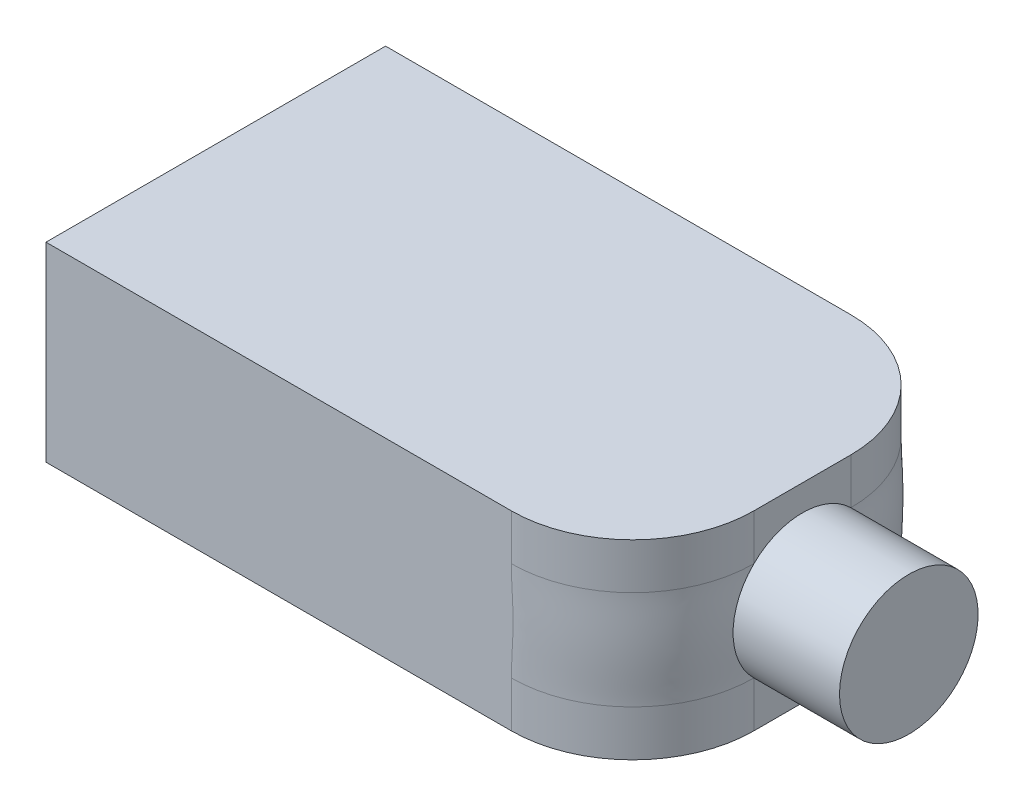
ISO-10303-21;
HEADER;
FILE_DESCRIPTION(('STEP AP214'),'2;1');
FILE_NAME('part.step','',(''),(''),'','','');
FILE_SCHEMA(('AUTOMOTIVE_DESIGN { 1 0 10303 214 1 1 1 1 }'));
ENDSEC;
DATA;
#1=APPLICATION_CONTEXT('core data for automotive mechanical design processes');
#2=APPLICATION_PROTOCOL_DEFINITION('international standard','automotive_design',2000,#1);
#3=PRODUCT_CONTEXT('',#1,'mechanical');
#4=PRODUCT('Part','Part','',(#3));
#5=PRODUCT_RELATED_PRODUCT_CATEGORY('part','',(#4));
#6=PRODUCT_DEFINITION_FORMATION('','',#4);
#7=PRODUCT_DEFINITION_CONTEXT('part definition',#1,'design');
#8=PRODUCT_DEFINITION('design','',#6,#7);
#9=PRODUCT_DEFINITION_SHAPE('','',#8);
#10=(LENGTH_UNIT() NAMED_UNIT(*) SI_UNIT(.MILLI.,.METRE.));
#11=(NAMED_UNIT(*) PLANE_ANGLE_UNIT() SI_UNIT($,.RADIAN.));
#12=(NAMED_UNIT(*) SI_UNIT($,.STERADIAN.) SOLID_ANGLE_UNIT());
#13=UNCERTAINTY_MEASURE_WITH_UNIT(LENGTH_MEASURE(1.E-05),#10,'distance_accuracy_value','');
#14=(GEOMETRIC_REPRESENTATION_CONTEXT(3) GLOBAL_UNCERTAINTY_ASSIGNED_CONTEXT((#13)) GLOBAL_UNIT_ASSIGNED_CONTEXT((#10,
#11,#12)) REPRESENTATION_CONTEXT('',''));
#15=CARTESIAN_POINT('',(0.,0.,0.));
#16=DIRECTION('',(0.,0.,1.));
#17=DIRECTION('',(1.,0.,0.));
#18=AXIS2_PLACEMENT_3D('',#15,#16,#17);
#19=CARTESIAN_POINT('',(43.,0.,24.892));
#20=DIRECTION('',(-1.,0.,0.));
#21=DIRECTION('',(0.,0.,1.));
#22=AXIS2_PLACEMENT_3D('',#19,#20,#21);
#23=PLANE('',#22);
#24=DIRECTION('',(0.,0.,-1.));
#25=VECTOR('',#24,1.);
#26=CARTESIAN_POINT('',(43.,0.,24.892));
#27=LINE('',#26,#25);
#28=CARTESIAN_POINT('',(43.,0.,16.002));
#29=VERTEX_POINT('',#28);
#30=CARTESIAN_POINT('',(43.,0.,8.89));
#31=VERTEX_POINT('',#30);
#32=EDGE_CURVE('E157',#29,#31,#27,.T.);
#33=ORIENTED_EDGE('',*,*,#32,.T.);
#34=DIRECTION('',(0.,1.,0.));
#35=VECTOR('',#34,1.);
#36=CARTESIAN_POINT('',(43.,13.97,8.89));
#37=LINE('',#36,#35);
#38=CARTESIAN_POINT('',(43.,3.35715435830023,8.89));
#39=VERTEX_POINT('',#38);
#40=EDGE_CURVE('E160',#31,#39,#37,.T.);
#41=ORIENTED_EDGE('',*,*,#40,.T.);
#42=CARTESIAN_POINT('',(43.,6.985,12.446));
#43=DIRECTION('',(-1.,0.,0.));
#44=DIRECTION('',(0.,0.,1.));
#45=AXIS2_PLACEMENT_3D('',#42,#43,#44);
#46=CIRCLE('',#45,5.08);
#47=CARTESIAN_POINT('',(43.,3.35715435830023,16.002));
#48=VERTEX_POINT('',#47);
#49=EDGE_CURVE('E163',#48,#39,#46,.F.);
#50=ORIENTED_EDGE('',*,*,#49,.F.);
#51=DIRECTION('',(0.,1.,0.));
#52=VECTOR('',#51,1.);
#53=CARTESIAN_POINT('',(43.,0.,16.002));
#54=LINE('',#53,#52);
#55=EDGE_CURVE('E147',#48,#29,#54,.F.);
#56=ORIENTED_EDGE('',*,*,#55,.T.);
#57=EDGE_LOOP('',(#33,#41,#50,#56));
#58=FACE_BOUND('',#57,.T.);
#59=ADVANCED_FACE('F36',(#58),#23,.F.);
#60=CARTESIAN_POINT('',(0.,0.,24.892));
#61=DIRECTION('',(1.,0.,0.));
#62=DIRECTION('',(0.,0.,-1.));
#63=AXIS2_PLACEMENT_3D('',#60,#61,#62);
#64=PLANE('',#63);
#65=DIRECTION('',(0.,-1.,0.));
#66=VECTOR('',#65,1.);
#67=CARTESIAN_POINT('',(0.,0.,0.));
#68=LINE('',#67,#66);
#69=CARTESIAN_POINT('',(0.,13.97,0.));
#70=VERTEX_POINT('',#69);
#71=CARTESIAN_POINT('',(0.,0.,0.));
#72=VERTEX_POINT('',#71);
#73=EDGE_CURVE('E133',#70,#72,#68,.T.);
#74=ORIENTED_EDGE('',*,*,#73,.T.);
#75=DIRECTION('',(0.,0.,-1.));
#76=VECTOR('',#75,1.);
#77=CARTESIAN_POINT('',(0.,0.,24.892));
#78=LINE('',#77,#76);
#79=CARTESIAN_POINT('',(0.,0.,24.892));
#80=VERTEX_POINT('',#79);
#81=EDGE_CURVE('E137',#80,#72,#78,.T.);
#82=ORIENTED_EDGE('',*,*,#81,.F.);
#83=DIRECTION('',(0.,-1.,0.));
#84=VECTOR('',#83,1.);
#85=CARTESIAN_POINT('',(0.,0.,24.892));
#86=LINE('',#85,#84);
#87=CARTESIAN_POINT('',(0.,13.97,24.892));
#88=VERTEX_POINT('',#87);
#89=EDGE_CURVE('E116',#88,#80,#86,.T.);
#90=ORIENTED_EDGE('',*,*,#89,.F.);
#91=DIRECTION('',(0.,0.,-1.));
#92=VECTOR('',#91,1.);
#93=CARTESIAN_POINT('',(0.,13.97,24.892));
#94=LINE('',#93,#92);
#95=EDGE_CURVE('E124',#88,#70,#94,.T.);
#96=ORIENTED_EDGE('',*,*,#95,.T.);
#97=EDGE_LOOP('',(#74,#82,#90,#96));
#98=FACE_BOUND('',#97,.T.);
#99=ADVANCED_FACE('F135',(#98),#64,.F.);
#100=CARTESIAN_POINT('',(43.,10.6128456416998,8.89));
#101=VERTEX_POINT('',#100);
#102=CARTESIAN_POINT('',(43.,10.6128456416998,16.002));
#103=VERTEX_POINT('',#102);
#104=EDGE_CURVE('E267',#101,#103,#46,.F.);
#105=ORIENTED_EDGE('',*,*,#104,.F.);
#106=DIRECTION('',(0.,1.,0.));
#107=VECTOR('',#106,1.);
#108=CARTESIAN_POINT('',(43.,13.97,8.89));
#109=LINE('',#108,#107);
#110=CARTESIAN_POINT('',(43.,13.97,8.89));
#111=VERTEX_POINT('',#110);
#112=EDGE_CURVE('E132',#101,#111,#109,.T.);
#113=ORIENTED_EDGE('',*,*,#112,.T.);
#114=DIRECTION('',(0.,0.,-1.));
#115=VECTOR('',#114,1.);
#116=CARTESIAN_POINT('',(43.,13.97,24.892));
#117=LINE('',#116,#115);
#118=CARTESIAN_POINT('',(43.,13.97,16.002));
#119=VERTEX_POINT('',#118);
#120=EDGE_CURVE('E155',#119,#111,#117,.T.);
#121=ORIENTED_EDGE('',*,*,#120,.F.);
#122=DIRECTION('',(0.,1.,0.));
#123=VECTOR('',#122,1.);
#124=CARTESIAN_POINT('',(43.,0.,16.002));
#125=LINE('',#124,#123);
#126=EDGE_CURVE('E152',#119,#103,#125,.F.);
#127=ORIENTED_EDGE('',*,*,#126,.T.);
#128=EDGE_LOOP('',(#105,#113,#121,#127));
#129=FACE_BOUND('',#128,.T.);
#130=ADVANCED_FACE('F253',(#129),#23,.F.);
#131=CARTESIAN_POINT('',(0.,0.,24.892));
#132=DIRECTION('',(0.,1.,0.));
#133=DIRECTION('',(0.,0.,1.));
#134=AXIS2_PLACEMENT_3D('',#131,#132,#133);
#135=PLANE('',#134);
#136=DIRECTION('',(1.,0.,0.));
#137=VECTOR('',#136,1.);
#138=CARTESIAN_POINT('',(0.,0.,0.));
#139=LINE('',#138,#137);
#140=CARTESIAN_POINT('',(34.11,0.,0.));
#141=VERTEX_POINT('',#140);
#142=EDGE_CURVE('E148',#72,#141,#139,.T.);
#143=ORIENTED_EDGE('',*,*,#142,.T.);
#144=CARTESIAN_POINT('',(34.11,0.,8.89));
#145=DIRECTION('',(0.,1.,0.));
#146=DIRECTION('',(0.,0.,1.));
#147=AXIS2_PLACEMENT_3D('',#144,#145,#146);
#148=CIRCLE('',#147,8.89);
#149=EDGE_CURVE('E151',#141,#31,#148,.F.);
#150=ORIENTED_EDGE('',*,*,#149,.T.);
#151=ORIENTED_EDGE('',*,*,#32,.F.);
#152=CARTESIAN_POINT('',(34.11,0.,16.002));
#153=DIRECTION('',(0.,1.,0.));
#154=DIRECTION('',(0.,0.,1.));
#155=AXIS2_PLACEMENT_3D('',#152,#153,#154);
#156=CIRCLE('',#155,8.89);
#157=CARTESIAN_POINT('',(34.11,0.,24.892));
#158=VERTEX_POINT('',#157);
#159=EDGE_CURVE('E162',#29,#158,#156,.F.);
#160=ORIENTED_EDGE('',*,*,#159,.T.);
#161=DIRECTION('',(1.,0.,0.));
#162=VECTOR('',#161,1.);
#163=CARTESIAN_POINT('',(0.,0.,24.892));
#164=LINE('',#163,#162);
#165=EDGE_CURVE('E142',#80,#158,#164,.T.);
#166=ORIENTED_EDGE('',*,*,#165,.F.);
#167=ORIENTED_EDGE('',*,*,#81,.T.);
#168=EDGE_LOOP('',(#143,#150,#151,#160,#166,#167));
#169=FACE_BOUND('',#168,.T.);
#170=ADVANCED_FACE('F260',(#169),#135,.F.);
#171=CARTESIAN_POINT('',(0.,13.97,24.892));
#172=DIRECTION('',(0.,-1.,0.));
#173=DIRECTION('',(1.,0.,0.));
#174=AXIS2_PLACEMENT_3D('',#171,#172,#173);
#175=PLANE('',#174);
#176=ORIENTED_EDGE('',*,*,#120,.T.);
#177=CARTESIAN_POINT('',(34.11,13.97,8.89));
#178=DIRECTION('',(0.,-1.,0.));
#179=DIRECTION('',(1.,0.,0.));
#180=AXIS2_PLACEMENT_3D('',#177,#178,#179);
#181=CIRCLE('',#180,8.89);
#182=CARTESIAN_POINT('',(34.11,13.97,0.));
#183=VERTEX_POINT('',#182);
#184=EDGE_CURVE('E153',#111,#183,#181,.F.);
#185=ORIENTED_EDGE('',*,*,#184,.T.);
#186=DIRECTION('',(-1.,0.,0.));
#187=VECTOR('',#186,1.);
#188=CARTESIAN_POINT('',(0.,13.97,0.));
#189=LINE('',#188,#187);
#190=EDGE_CURVE('E128',#183,#70,#189,.T.);
#191=ORIENTED_EDGE('',*,*,#190,.T.);
#192=ORIENTED_EDGE('',*,*,#95,.F.);
#193=DIRECTION('',(-1.,0.,0.));
#194=VECTOR('',#193,1.);
#195=CARTESIAN_POINT('',(0.,13.97,24.892));
#196=LINE('',#195,#194);
#197=CARTESIAN_POINT('',(34.11,13.97,24.892));
#198=VERTEX_POINT('',#197);
#199=EDGE_CURVE('E111',#198,#88,#196,.T.);
#200=ORIENTED_EDGE('',*,*,#199,.F.);
#201=CARTESIAN_POINT('',(34.11,13.97,16.002));
#202=DIRECTION('',(0.,-1.,0.));
#203=DIRECTION('',(1.,0.,0.));
#204=AXIS2_PLACEMENT_3D('',#201,#202,#203);
#205=CIRCLE('',#204,8.89);
#206=EDGE_CURVE('E144',#198,#119,#205,.F.);
#207=ORIENTED_EDGE('',*,*,#206,.T.);
#208=EDGE_LOOP('',(#176,#185,#191,#192,#200,#207));
#209=FACE_BOUND('',#208,.T.);
#210=ADVANCED_FACE('F126',(#209),#175,.F.);
#211=CARTESIAN_POINT('',(0.,0.,24.892));
#212=DIRECTION('',(0.,0.,-1.));
#213=DIRECTION('',(-1.,0.,0.));
#214=AXIS2_PLACEMENT_3D('',#211,#212,#213);
#215=PLANE('',#214);
#216=ORIENTED_EDGE('',*,*,#165,.T.);
#217=DIRECTION('',(0.,1.,0.));
#218=VECTOR('',#217,1.);
#219=CARTESIAN_POINT('',(34.11,0.,24.892));
#220=LINE('',#219,#218);
#221=CARTESIAN_POINT('',(34.11,3.35715435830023,24.892));
#222=VERTEX_POINT('',#221);
#223=EDGE_CURVE('E143',#158,#222,#220,.T.);
#224=ORIENTED_EDGE('',*,*,#223,.T.);
#225=CARTESIAN_POINT('',(43.,2.07233107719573,13.7390908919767));
#226=CARTESIAN_POINT('',(43.,5.0079503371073,24.892));
#227=CARTESIAN_POINT('',(43.,-6.52483952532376,24.892));
#228=CARTESIAN_POINT('',(43.,2.07233380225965,13.7390966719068));
#229=CARTESIAN_POINT('',(43.0828515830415,5.00797513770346,24.892));
#230=CARTESIAN_POINT('',(42.757362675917,-6.52486518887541,24.892));
#231=CARTESIAN_POINT('',(43.,2.07257319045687,13.7400105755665));
#232=CARTESIAN_POINT('',(43.165688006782,5.00316824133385,24.892));
#233=CARTESIAN_POINT('',(42.5147369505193,-6.51456795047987,24.892));
#234=CARTESIAN_POINT('',(43.,2.07354468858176,13.7436954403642));
#235=CARTESIAN_POINT('',(43.3299728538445,4.98408228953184,24.892));
#236=CARTESIAN_POINT('',(42.0312381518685,-6.47352421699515,24.892));
#237=CARTESIAN_POINT('',(43.,2.07427676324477,13.7464662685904));
#238=CARTESIAN_POINT('',(43.4113987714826,4.9698092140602,24.892));
#239=CARTESIAN_POINT('',(41.7903649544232,-6.44277918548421,24.892));
#240=CARTESIAN_POINT('',(43.,2.07625284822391,13.7539051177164));
#241=CARTESIAN_POINT('',(43.5714593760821,4.93200930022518,24.892));
#242=CARTESIAN_POINT('',(41.3121081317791,-6.36104365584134,24.892));
#243=CARTESIAN_POINT('',(43.,2.07749676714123,13.7585727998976));
#244=CARTESIAN_POINT('',(43.6500732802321,4.90849468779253,24.892));
#245=CARTESIAN_POINT('',(41.0747238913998,-6.31005677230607,24.892));
#246=CARTESIAN_POINT('',(43.,2.0805371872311,13.7698873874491));
#247=CARTESIAN_POINT('',(43.8031235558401,4.85266348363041,24.892));
#248=CARTESIAN_POINT('',(40.6051569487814,-6.18827483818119,24.892));
#249=CARTESIAN_POINT('',(43.,2.08233368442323,13.7765342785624));
#250=CARTESIAN_POINT('',(43.8775408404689,4.82036270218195,24.892));
#251=CARTESIAN_POINT('',(40.3729742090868,-6.11747993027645,24.892));
#252=CARTESIAN_POINT('',(43.,2.08863470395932,13.7996142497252));
#253=CARTESIAN_POINT('',(44.0924022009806,4.71112843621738,24.892));
#254=CARTESIAN_POINT('',(39.6865747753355,-5.87606880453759,24.892));
#255=CARTESIAN_POINT('',(43.,2.09405177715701,13.8191906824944));
#256=CARTESIAN_POINT('',(44.2247052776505,4.62184324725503,24.892));
#257=CARTESIAN_POINT('',(39.242226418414,-5.67637788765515,24.892));
#258=CARTESIAN_POINT('',(43.,2.10804706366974,13.8681101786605));
#259=CARTESIAN_POINT('',(44.4566486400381,4.41705545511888,24.892));
#260=CARTESIAN_POINT('',(38.3936169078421,-5.20579959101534,24.892));
#261=CARTESIAN_POINT('',(43.,2.11662215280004,13.8974435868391));
#262=CARTESIAN_POINT('',(44.556272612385,4.30182039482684,24.892));
#263=CARTESIAN_POINT('',(37.9893166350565,-4.93498265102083,24.892));
#264=CARTESIAN_POINT('',(43.,2.13289075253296,13.9505828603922));
#265=CARTESIAN_POINT('',(44.6745076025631,4.11641609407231,24.892));
#266=CARTESIAN_POINT('',(37.4197164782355,-4.48093061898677,24.892));
#267=CARTESIAN_POINT('',(43.,2.13890780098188,13.9699011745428));
#268=CARTESIAN_POINT('',(44.7087197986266,4.05245668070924,24.892));
#269=CARTESIAN_POINT('',(37.2354242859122,-4.3209779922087,24.892));
#270=CARTESIAN_POINT('',(43.,2.15235189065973,14.0120156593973));
#271=CARTESIAN_POINT('',(44.765399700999,3.92216984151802,24.892));
#272=CARTESIAN_POINT('',(36.8807238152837,-3.98638569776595,24.892));
#273=CARTESIAN_POINT('',(43.,2.15977848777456,14.0348107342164));
#274=CARTESIAN_POINT('',(44.787892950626,3.8558824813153,24.892));
#275=CARTESIAN_POINT('',(36.7103111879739,-3.81175066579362,24.892));
#276=CARTESIAN_POINT('',(43.,2.17640128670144,14.0844338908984));
#277=CARTESIAN_POINT('',(44.820143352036,3.72264565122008,24.892));
#278=CARTESIAN_POINT('',(36.3840248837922,-3.44866022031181,24.892));
#279=CARTESIAN_POINT('',(43.,2.18560166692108,14.1112714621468));
#280=CARTESIAN_POINT('',(44.8299068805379,3.65573310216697,24.892));
#281=CARTESIAN_POINT('',(36.2281868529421,-3.26017283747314,24.892));
#282=CARTESIAN_POINT('',(43.,2.20622477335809,14.1695618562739));
#283=CARTESIAN_POINT('',(44.835668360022,3.52357905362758,24.892));
#284=CARTESIAN_POINT('',(35.9323714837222,-2.8711316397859,24.892));
#285=CARTESIAN_POINT('',(43.,2.21764758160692,14.2010148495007));
#286=CARTESIAN_POINT('',(44.8317208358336,3.45837221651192,24.892));
#287=CARTESIAN_POINT('',(35.7923947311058,-2.67057737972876,24.892));
#288=CARTESIAN_POINT('',(43.,2.24367405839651,14.2701801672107));
#289=CARTESIAN_POINT('',(44.8089578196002,3.33051823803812,24.892));
#290=CARTESIAN_POINT('',(35.5255978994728,-2.25353574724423,24.892));
#291=CARTESIAN_POINT('',(43.,2.25835251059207,14.3080336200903));
#292=CARTESIAN_POINT('',(44.7898408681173,3.26800004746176,24.892));
#293=CARTESIAN_POINT('',(35.3992129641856,-2.03677010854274,24.892));
#294=CARTESIAN_POINT('',(43.,2.29163296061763,14.3903986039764));
#295=CARTESIAN_POINT('',(44.7355590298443,3.15052267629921,24.892));
#296=CARTESIAN_POINT('',(35.1644293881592,-1.59373855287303,24.892));
#297=CARTESIAN_POINT('',(43.,2.31023469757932,14.4349096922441));
#298=CARTESIAN_POINT('',(44.7005095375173,3.09557122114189,24.892));
#299=CARTESIAN_POINT('',(35.0560295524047,-1.3674732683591,24.892));
#300=CARTESIAN_POINT('',(43.,2.35254640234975,14.5315566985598));
#301=CARTESIAN_POINT('',(44.6141194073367,2.99715444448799,24.892));
#302=CARTESIAN_POINT('',(34.8580147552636,-0.908320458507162,24.892));
#303=CARTESIAN_POINT('',(43.,2.37622854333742,14.5836506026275));
#304=CARTESIAN_POINT('',(44.5630174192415,2.95360736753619,24.892));
#305=CARTESIAN_POINT('',(34.7683025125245,-0.675474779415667,24.892));
#306=CARTESIAN_POINT('',(43.,2.4305611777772,14.6971051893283));
#307=CARTESIAN_POINT('',(44.4442781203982,2.88181952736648,24.892));
#308=CARTESIAN_POINT('',(34.606901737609,-0.20355182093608,24.892));
#309=CARTESIAN_POINT('',(43.,2.46121352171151,14.7584683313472));
#310=CARTESIAN_POINT('',(44.3768273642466,2.85350899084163,24.892));
#311=CARTESIAN_POINT('',(34.535218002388,0.0355270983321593,24.892));
#312=CARTESIAN_POINT('',(43.,2.52110913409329,14.8714451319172));
#313=CARTESIAN_POINT('',(44.2489034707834,2.82278184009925,24.892));
#314=CARTESIAN_POINT('',(34.4290031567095,0.443554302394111,24.892));
#315=CARTESIAN_POINT('',(43.,2.54785471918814,14.9202021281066));
#316=CARTESIAN_POINT('',(44.1929407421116,2.81503228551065,24.892));
#317=CARTESIAN_POINT('',(34.3898389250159,0.61131724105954,24.892));
#318=CARTESIAN_POINT('',(43.,2.60707300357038,15.0235402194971));
#319=CARTESIAN_POINT('',(44.0735675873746,2.811083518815,24.892));
#320=CARTESIAN_POINT('',(34.3197221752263,0.948549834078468,24.892));
#321=CARTESIAN_POINT('',(43.,2.63954559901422,15.0781212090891));
#322=CARTESIAN_POINT('',(44.0102460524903,2.81481000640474,24.892));
#323=CARTESIAN_POINT('',(34.2887695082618,1.11801945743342,24.892));
#324=CARTESIAN_POINT('',(43.,2.71168815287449,15.1936992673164));
#325=CARTESIAN_POINT('',(43.876621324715,2.83588250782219,24.892));
#326=CARTESIAN_POINT('',(34.2347585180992,1.4581680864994,24.892));
#327=CARTESIAN_POINT('',(43.,2.75135666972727,15.2546950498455));
#328=CARTESIAN_POINT('',(43.8064175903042,2.85312086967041,24.892));
#329=CARTESIAN_POINT('',(34.2116986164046,1.62884684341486,24.892));
#330=CARTESIAN_POINT('',(43.,2.83979798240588,15.3836560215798));
#331=CARTESIAN_POINT('',(43.6597233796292,2.90350683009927,24.892));
#332=CARTESIAN_POINT('',(34.1730174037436,1.9710335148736,24.892));
#333=CARTESIAN_POINT('',(43.,2.88857055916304,15.4516210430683));
#334=CARTESIAN_POINT('',(43.5833371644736,2.93651112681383,24.892));
#335=CARTESIAN_POINT('',(34.1573959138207,2.14254140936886,24.892));
#336=CARTESIAN_POINT('',(43.,2.99806333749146,15.5954413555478));
#337=CARTESIAN_POINT('',(43.4247123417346,3.02124668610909,24.892));
#338=CARTESIAN_POINT('',(34.1329092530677,2.48735846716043,24.892));
#339=CARTESIAN_POINT('',(43.,3.0588727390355,15.6713534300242));
#340=CARTESIAN_POINT('',(43.3425340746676,3.07293215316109,24.892));
#341=CARTESIAN_POINT('',(34.1240970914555,2.66067132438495,24.892));
#342=CARTESIAN_POINT('',(43.,3.19530803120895,15.8306188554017));
#343=CARTESIAN_POINT('',(43.1743688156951,3.19770084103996,24.892));
#344=CARTESIAN_POINT('',(34.1126556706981,3.00749260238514,24.892));
#345=CARTESIAN_POINT('',(43.,3.27093410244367,15.9139722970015));
#346=CARTESIAN_POINT('',(43.0884776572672,3.27054358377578,24.892));
#347=CARTESIAN_POINT('',(34.1100264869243,3.18100102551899,24.892));
#348=CARTESIAN_POINT('',(43.,3.44084898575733,16.0874501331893));
#349=CARTESIAN_POINT('',(42.9149469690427,3.44041107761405,24.892));
#350=CARTESIAN_POINT('',(34.1099738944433,3.52815054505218,24.892));
#351=CARTESIAN_POINT('',(43.,3.53515310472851,16.1775800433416));
#352=CARTESIAN_POINT('',(42.8273741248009,3.53717156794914,24.892));
#353=CARTESIAN_POINT('',(34.1125547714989,3.70179163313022,24.892));
#354=CARTESIAN_POINT('',(43.,3.74672474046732,16.3625976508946));
#355=CARTESIAN_POINT('',(42.6534402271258,3.75731991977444,24.892));
#356=CARTESIAN_POINT('',(34.1217177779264,4.04895893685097,24.892));
#357=CARTESIAN_POINT('',(43.,3.86399240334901,16.4574853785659));
#358=CARTESIAN_POINT('',(42.5670984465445,3.88040197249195,24.892));
#359=CARTESIAN_POINT('',(34.1282999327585,4.2224851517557,24.892));
#360=CARTESIAN_POINT('',(43.,4.09790945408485,16.6277791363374));
#361=CARTESIAN_POINT('',(42.4171901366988,4.12582834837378,24.892));
#362=CARTESIAN_POINT('',(34.1423191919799,4.53239554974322,24.892));
#363=CARTESIAN_POINT('',(43.,4.20934978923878,16.7030211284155));
#364=CARTESIAN_POINT('',(42.3527916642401,4.24236448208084,24.892));
#365=CARTESIAN_POINT('',(34.1492740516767,4.66880303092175,24.892));
#366=CARTESIAN_POINT('',(43.,4.4508444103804,16.8510549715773));
#367=CARTESIAN_POINT('',(42.2293790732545,4.49306522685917,24.892));
#368=CARTESIAN_POINT('',(34.1639284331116,4.94157943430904,24.892));
#369=CARTESIAN_POINT('',(43.,4.58089904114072,16.923846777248));
#370=CARTESIAN_POINT('',(42.1703031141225,4.62713886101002,24.892));
#371=CARTESIAN_POINT('',(34.1716279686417,5.0779483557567,24.892));
#372=CARTESIAN_POINT('',(43.,4.86039819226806,17.0630117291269));
#373=CARTESIAN_POINT('',(42.060069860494,4.912217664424,24.892));
#374=CARTESIAN_POINT('',(34.1868919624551,5.35069538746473,24.892));
#375=CARTESIAN_POINT('',(43.,5.00984291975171,17.1293848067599));
#376=CARTESIAN_POINT('',(42.0088175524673,5.0632073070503,24.892));
#377=CARTESIAN_POINT('',(34.1944564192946,5.4870734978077,24.892));
#378=CARTESIAN_POINT('',(43.,5.32727733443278,17.2509124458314));
#379=CARTESIAN_POINT('',(41.9168889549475,5.38022114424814,24.892));
#380=CARTESIAN_POINT('',(34.2085606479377,5.75988357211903,24.892));
#381=CARTESIAN_POINT('',(43.,5.49526683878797,17.3060671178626));
#382=CARTESIAN_POINT('',(41.876095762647,5.54633920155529,24.892));
#383=CARTESIAN_POINT('',(34.2151004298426,5.89631553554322,24.892));
#384=CARTESIAN_POINT('',(43.,5.84653723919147,17.4001158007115));
#385=CARTESIAN_POINT('',(41.8075879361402,5.89014331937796,24.892));
#386=CARTESIAN_POINT('',(34.2263414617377,6.16912149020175,24.892));
#387=CARTESIAN_POINT('',(43.,6.02980264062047,17.439026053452));
#388=CARTESIAN_POINT('',(41.7797458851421,6.06803913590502,24.892));
#389=CARTESIAN_POINT('',(34.2310445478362,6.30549540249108,24.892));
#390=CARTESIAN_POINT('',(43.,6.40627236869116,17.4965128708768));
#391=CARTESIAN_POINT('',(41.7389573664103,6.43090411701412,24.892));
#392=CARTESIAN_POINT('',(34.2380108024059,6.57830633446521,24.892));
#393=CARTESIAN_POINT('',(43.,6.59947654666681,17.5150897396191));
#394=CARTESIAN_POINT('',(41.7259292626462,6.61621089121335,24.892));
#395=CARTESIAN_POINT('',(34.2402740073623,6.71474335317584,24.892));
#396=CARTESIAN_POINT('',(43.,6.98844916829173,17.5297236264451));
#397=CARTESIAN_POINT('',(41.7156745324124,6.98829662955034,24.892));
#398=CARTESIAN_POINT('',(34.2420560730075,6.98761533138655,24.892));
#399=CARTESIAN_POINT('',(43.,7.18421721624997,17.5257840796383));
#400=CARTESIAN_POINT('',(41.7184233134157,7.1754763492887,24.892));
#401=CARTESIAN_POINT('',(34.2415753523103,7.12405028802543,24.892));
#402=CARTESIAN_POINT('',(43.,7.57048102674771,17.4958678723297));
#403=CARTESIAN_POINT('',(41.7394424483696,7.54556993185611,24.892));
#404=CARTESIAN_POINT('',(34.2379357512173,7.39688413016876,24.892));
#405=CARTESIAN_POINT('',(43.,7.76097673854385,17.4698909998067));
#406=CARTESIAN_POINT('',(41.7577576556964,7.72887081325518,24.892));
#407=CARTESIAN_POINT('',(34.2347768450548,7.53328301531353,24.892));
#408=CARTESIAN_POINT('',(43.,8.1289954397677,17.3990477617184));
#409=CARTESIAN_POINT('',(41.8084075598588,8.08520337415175,24.892));
#410=CARTESIAN_POINT('',(34.2262220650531,7.8053574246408,24.892));
#411=CARTESIAN_POINT('',(43.,8.30657587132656,17.3542719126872));
#412=CARTESIAN_POINT('',(41.8407706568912,8.25858070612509,24.892));
#413=CARTESIAN_POINT('',(34.2208369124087,7.94103330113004,24.892));
#414=CARTESIAN_POINT('',(43.,8.64514631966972,17.2503452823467));
#415=CARTESIAN_POINT('',(41.9173660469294,8.59211717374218,24.892));
#416=CARTESIAN_POINT('',(34.2085118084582,8.21231314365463,24.892));
#417=CARTESIAN_POINT('',(43.,8.80613612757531,17.1911943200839));
#418=CARTESIAN_POINT('',(41.9617151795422,8.75245148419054,24.892));
#419=CARTESIAN_POINT('',(34.2015718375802,8.34791710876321,24.892));
#420=CARTESIAN_POINT('',(43.,9.10933956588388,17.0634346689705));
#421=CARTESIAN_POINT('',(42.0597848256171,9.0574317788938,24.892));
#422=CARTESIAN_POINT('',(34.1869674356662,8.61912818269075,24.892));
#423=CARTESIAN_POINT('',(43.,9.25154714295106,16.9948229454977));
#424=CARTESIAN_POINT('',(42.1136179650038,9.20212554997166,24.892));
#425=CARTESIAN_POINT('',(34.1793027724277,8.75473527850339,24.892));
#426=CARTESIAN_POINT('',(43.,9.51690048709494,16.8526502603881));
#427=CARTESIAN_POINT('',(42.2280991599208,9.47451693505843,24.892));
#428=CARTESIAN_POINT('',(34.1641305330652,9.02595777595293,24.892));
#429=CARTESIAN_POINT('',(43.,9.64004636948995,16.7790893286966));
#430=CARTESIAN_POINT('',(42.2888306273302,9.60217081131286,24.892));
#431=CARTESIAN_POINT('',(34.1566229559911,9.16157317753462,24.892));
#432=CARTESIAN_POINT('',(43.,9.8684306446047,16.6305906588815));
#433=CARTESIAN_POINT('',(42.4147723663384,9.84026000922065,24.892));
#434=CARTESIAN_POINT('',(34.1426134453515,9.43288425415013,24.892));
#435=CARTESIAN_POINT('',(43.,9.97366557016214,16.5556526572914));
#436=CARTESIAN_POINT('',(42.4800330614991,9.95058523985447,24.892));
#437=CARTESIAN_POINT('',(34.1361117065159,9.56857993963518,24.892));
#438=CARTESIAN_POINT('',(43.,10.1680568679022,16.4070004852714));
#439=CARTESIAN_POINT('',(42.6129827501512,10.1544413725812,24.892));
#440=CARTESIAN_POINT('',(34.1248928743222,9.84004927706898,24.892));
#441=CARTESIAN_POINT('',(43.,10.2572131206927,16.3332863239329));
#442=CARTESIAN_POINT('',(42.6806888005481,10.2478342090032,24.892));
#443=CARTESIAN_POINT('',(34.1201757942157,9.97582292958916,24.892));
#444=CARTESIAN_POINT('',(43.,10.4215346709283,16.1888056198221));
#445=CARTESIAN_POINT('',(42.8168049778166,10.4186901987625,24.892));
#446=CARTESIAN_POINT('',(34.113213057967,10.2473932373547,24.892));
#447=CARTESIAN_POINT('',(43.,10.4967045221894,16.1180381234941));
#448=CARTESIAN_POINT('',(42.8852053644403,10.4960128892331,24.892));
#449=CARTESIAN_POINT('',(34.1109665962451,10.3831898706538,24.892));
#450=CARTESIAN_POINT('',(43.,10.635166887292,15.9804310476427));
#451=CARTESIAN_POINT('',(43.0213514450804,10.6359007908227,24.892));
#452=CARTESIAN_POINT('',(34.1095322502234,10.654796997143,24.892));
#453=CARTESIAN_POINT('',(43.,10.6984599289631,15.9135912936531));
#454=CARTESIAN_POINT('',(43.0890681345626,10.6983275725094,24.892));
#455=CARTESIAN_POINT('',(34.1103442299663,10.7906074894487,24.892));
#456=CARTESIAN_POINT('',(43.,10.8188233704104,15.7801839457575));
#457=CARTESIAN_POINT('',(43.22708473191,10.8132836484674,24.892));
#458=CARTESIAN_POINT('',(34.1156940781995,11.0708970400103,24.892));
#459=CARTESIAN_POINT('',(43.,10.8752319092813,15.7139102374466));
#460=CARTESIAN_POINT('',(43.2971871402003,10.8647438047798,24.892));
#461=CARTESIAN_POINT('',(34.1204681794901,11.215371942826,24.892));
#462=CARTESIAN_POINT('',(43.,10.9787441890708,15.5865623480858));
#463=CARTESIAN_POINT('',(43.4343935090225,10.9539069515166,24.892));
#464=CARTESIAN_POINT('',(34.1345510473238,11.504113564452,24.892));
#465=CARTESIAN_POINT('',(43.,11.0258473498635,15.5254884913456));
#466=CARTESIAN_POINT('',(43.5014383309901,10.9914820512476,24.892));
#467=CARTESIAN_POINT('',(34.1438600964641,11.6483802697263,24.892));
#468=CARTESIAN_POINT('',(43.,11.1124311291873,15.4084339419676));
#469=CARTESIAN_POINT('',(43.6317758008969,11.054373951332,24.892));
#470=CARTESIAN_POINT('',(34.1674297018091,11.9365721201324,24.892));
#471=CARTESIAN_POINT('',(43.,11.1519087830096,15.3524552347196));
#472=CARTESIAN_POINT('',(43.6950047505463,11.0795822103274,24.892));
#473=CARTESIAN_POINT('',(34.1816921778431,12.0804971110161,24.892));
#474=CARTESIAN_POINT('',(43.,11.2245802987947,15.2453787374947));
#475=CARTESIAN_POINT('',(43.8171038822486,11.1191187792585,24.892));
#476=CARTESIAN_POINT('',(34.2154940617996,12.367717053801,24.892));
#477=CARTESIAN_POINT('',(43.,11.2577742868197,15.1942808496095));
#478=CARTESIAN_POINT('',(43.8759127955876,11.1333651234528,24.892));
#479=CARTESIAN_POINT('',(34.23503336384,12.5110120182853,24.892));
#480=CARTESIAN_POINT('',(43.,11.3494410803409,15.0481891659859));
#481=CARTESIAN_POINT('',(44.0452369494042,11.1618259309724,24.892));
#482=CARTESIAN_POINT('',(34.3018149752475,12.938532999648,24.892));
#483=CARTESIAN_POINT('',(43.,11.400319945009,14.9599420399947));
#484=CARTESIAN_POINT('',(44.1478030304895,11.1614449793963,24.892));
#485=CARTESIAN_POINT('',(34.3573092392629,13.2215317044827,24.892));
#486=CARTESIAN_POINT('',(43.,11.4882724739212,14.7987107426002));
#487=CARTESIAN_POINT('',(44.3321173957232,11.1322500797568,24.892));
#488=CARTESIAN_POINT('',(34.4917380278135,13.7818676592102,24.892));
#489=CARTESIAN_POINT('',(43.,11.5253484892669,14.7257239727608));
#490=CARTESIAN_POINT('',(44.4134834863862,11.1031695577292,24.892));
#491=CARTESIAN_POINT('',(34.5706685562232,14.0592058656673,24.892));
#492=CARTESIAN_POINT('',(43.,11.5902227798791,14.5916716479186));
#493=CARTESIAN_POINT('',(44.5554262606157,11.0237711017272,24.892));
#494=CARTESIAN_POINT('',(34.7534800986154,14.6085312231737,24.892));
#495=CARTESIAN_POINT('',(43.,11.6179288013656,14.5307269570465));
#496=CARTESIAN_POINT('',(44.6154813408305,10.9731287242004,24.892));
#497=CARTESIAN_POINT('',(34.8575928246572,14.8804416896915,24.892));
#498=CARTESIAN_POINT('',(43.,11.666455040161,14.4193333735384));
#499=CARTESIAN_POINT('',(44.7138081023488,10.8571325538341,24.892));
#500=CARTESIAN_POINT('',(35.0904068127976,15.4135881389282,24.892));
#501=CARTESIAN_POINT('',(43.,11.6872744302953,14.3688857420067));
#502=CARTESIAN_POINT('',(44.7518445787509,10.7917434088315,24.892));
#503=CARTESIAN_POINT('',(35.2191110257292,15.6748228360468,24.892));
#504=CARTESIAN_POINT('',(43.,11.7240100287,14.2764791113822));
#505=CARTESIAN_POINT('',(44.80689553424,10.6515245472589,24.892));
#506=CARTESIAN_POINT('',(35.5010673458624,16.1848355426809,24.892));
#507=CARTESIAN_POINT('',(43.,11.7399098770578,14.2345485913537));
#508=CARTESIAN_POINT('',(44.8236711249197,10.5766870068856,24.892));
#509=CARTESIAN_POINT('',(35.6543988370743,16.4335697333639,24.892));
#510=CARTESIAN_POINT('',(43.,11.7680393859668,14.157897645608));
#511=CARTESIAN_POINT('',(44.8370678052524,10.4224407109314,24.892));
#512=CARTESIAN_POINT('',(35.9843393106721,16.9150724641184,24.892));
#513=CARTESIAN_POINT('',(43.,11.7802695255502,14.1231762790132));
#514=CARTESIAN_POINT('',(44.8335754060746,10.3430830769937,24.892));
#515=CARTESIAN_POINT('',(36.1609452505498,17.1478430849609,24.892));
#516=CARTESIAN_POINT('',(43.,11.8008589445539,14.0630342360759));
#517=CARTESIAN_POINT('',(44.8091871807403,10.1919929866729,24.892));
#518=CARTESIAN_POINT('',(36.5167675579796,17.571974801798,24.892));
#519=CARTESIAN_POINT('',(43.,11.8094869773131,14.0370242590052));
#520=CARTESIAN_POINT('',(44.7900559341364,10.1203329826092,24.892));
#521=CARTESIAN_POINT('',(36.6938470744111,17.7651325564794,24.892));
#522=CARTESIAN_POINT('',(43.,11.8249979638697,13.9891950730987));
#523=CARTESIAN_POINT('',(44.737901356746,9.978966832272,24.892));
#524=CARTESIAN_POINT('',(37.0644303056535,18.1349909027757,24.892));
#525=CARTESIAN_POINT('',(43.,11.8318810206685,13.9673756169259));
#526=CARTESIAN_POINT('',(44.704845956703,9.90930912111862,24.892));
#527=CARTESIAN_POINT('',(37.2579330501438,18.3116924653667,24.892));
#528=CARTESIAN_POINT('',(43.,11.8442400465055,13.927425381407));
#529=CARTESIAN_POINT('',(44.6262290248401,9.77416399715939,24.892));
#530=CARTESIAN_POINT('',(37.6596069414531,18.6468216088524,24.892));
#531=CARTESIAN_POINT('',(43.,11.8497183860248,13.9092883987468));
#532=CARTESIAN_POINT('',(44.5806724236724,9.708716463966,24.892));
#533=CARTESIAN_POINT('',(37.8677526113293,18.8052797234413,24.892));
#534=CARTESIAN_POINT('',(43.,11.8595407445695,13.8762270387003));
#535=CARTESIAN_POINT('',(44.478428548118,9.58361978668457,24.892));
#536=CARTESIAN_POINT('',(38.2974987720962,19.1029409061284,24.892));
#537=CARTESIAN_POINT('',(43.,11.8638843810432,13.8613037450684));
#538=CARTESIAN_POINT('',(44.4217342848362,9.52401610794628,24.892));
#539=CARTESIAN_POINT('',(38.519103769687,19.2421374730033,24.892));
#540=CARTESIAN_POINT('',(43.,11.8714175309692,13.8350641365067));
#541=CARTESIAN_POINT('',(44.302031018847,9.41512786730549,24.892));
#542=CARTESIAN_POINT('',(38.9618008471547,19.493094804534,24.892));
#543=CARTESIAN_POINT('',(43.,11.8746562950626,13.8235977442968));
#544=CARTESIAN_POINT('',(44.2395208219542,9.3654901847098,24.892));
#545=CARTESIAN_POINT('',(39.1822881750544,19.6059238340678,24.892));
#546=CARTESIAN_POINT('',(43.,11.8804045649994,13.8030290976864));
#547=CARTESIAN_POINT('',(44.1072344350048,9.27382854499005,24.892));
#548=CARTESIAN_POINT('',(39.6321134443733,19.8122842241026,24.892));
#549=CARTESIAN_POINT('',(43.,11.8829140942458,13.7939267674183));
#550=CARTESIAN_POINT('',(44.0374704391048,9.23183206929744,24.892));
#551=CARTESIAN_POINT('',(39.8614511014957,19.905816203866,24.892));
#552=CARTESIAN_POINT('',(43.,11.8872916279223,13.7779179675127));
#553=CARTESIAN_POINT('',(43.8921003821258,9.15632029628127,24.892));
#554=CARTESIAN_POINT('',(40.3272056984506,20.0728036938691,24.892));
#555=CARTESIAN_POINT('',(43.,11.8891599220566,13.7710105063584));
#556=CARTESIAN_POINT('',(43.8165136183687,9.12282362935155,24.892));
#557=CARTESIAN_POINT('',(40.5636193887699,20.1462682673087,24.892));
#558=CARTESIAN_POINT('',(43.,11.8923191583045,13.7592613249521));
#559=CARTESIAN_POINT('',(43.6609252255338,9.06494839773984,24.892));
#560=CARTESIAN_POINT('',(41.0418094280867,20.2725753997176,24.892));
#561=CARTESIAN_POINT('',(43.,11.8936102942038,13.7544189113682));
#562=CARTESIAN_POINT('',(43.5809451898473,9.04058375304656,24.892));
#563=CARTESIAN_POINT('',(41.2835839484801,20.3254248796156,24.892));
#564=CARTESIAN_POINT('',(43.,11.8956582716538,13.7467121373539));
#565=CARTESIAN_POINT('',(43.4181084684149,9.00145613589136,24.892));
#566=CARTESIAN_POINT('',(41.7704733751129,20.4100524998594,24.892));
#567=CARTESIAN_POINT('',(43.,11.8964157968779,13.743845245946));
#568=CARTESIAN_POINT('',(43.3352779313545,8.98669220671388,24.892));
#569=CARTESIAN_POINT('',(42.0155835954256,20.4418575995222,24.892));
#570=CARTESIAN_POINT('',(43.,11.8974191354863,13.7400396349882));
#571=CARTESIAN_POINT('',(43.1682850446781,8.9669820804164,24.892));
#572=CARTESIAN_POINT('',(42.507129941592,20.4842446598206,24.892));
#573=CARTESIAN_POINT('',(43.,11.8976659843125,13.7390970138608));
#574=CARTESIAN_POINT('',(43.0841493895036,8.96202166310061,24.892));
#575=CARTESIAN_POINT('',(42.7535623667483,20.4948695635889,24.892));
#576=CARTESIAN_POINT('',(43.,11.8976689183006,13.7390909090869));
#577=CARTESIAN_POINT('',(43.,8.96204968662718,24.892));
#578=CARTESIAN_POINT('',(43.,20.4948395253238,24.892));
#579=(BOUNDED_SURFACE() B_SPLINE_SURFACE(3,2,((#225,#226,#227),(#228,#229,#230),(#231,#232,
#233),(#234,#235,#236),(#237,#238,#239),(#240,#241,#242),(#243,#244,#245),(#246,#247,#248),
(#249,#250,#251),(#252,#253,#254),(#255,#256,#257),(#258,#259,#260),(#261,#262,#263),(#264,#265,
#266),(#267,#268,#269),(#270,#271,#272),(#273,#274,#275),(#276,#277,#278),(#279,#280,#281),
(#282,#283,#284),(#285,#286,#287),(#288,#289,#290),(#291,#292,#293),(#294,#295,#296),(#297,#298,
#299),(#300,#301,#302),(#303,#304,#305),(#306,#307,#308),(#309,#310,#311),(#312,#313,#314),
(#315,#316,#317),(#318,#319,#320),(#321,#322,#323),(#324,#325,#326),(#327,#328,#329),(#330,#331,
#332),(#333,#334,#335),(#336,#337,#338),(#339,#340,#341),(#342,#343,#344),(#345,#346,#347),
(#348,#349,#350),(#351,#352,#353),(#354,#355,#356),(#357,#358,#359),(#360,#361,#362),(#363,#364,
#365),(#366,#367,#368),(#369,#370,#371),(#372,#373,#374),(#375,#376,#377),(#378,#379,#380),
(#381,#382,#383),(#384,#385,#386),(#387,#388,#389),(#390,#391,#392),(#393,#394,#395),(#396,#397,
#398),(#399,#400,#401),(#402,#403,#404),(#405,#406,#407),(#408,#409,#410),(#411,#412,#413),
(#414,#415,#416),(#417,#418,#419),(#420,#421,#422),(#423,#424,#425),(#426,#427,#428),(#429,#430,
#431),(#432,#433,#434),(#435,#436,#437),(#438,#439,#440),(#441,#442,#443),(#444,#445,#446),
(#447,#448,#449),(#450,#451,#452),(#453,#454,#455),(#456,#457,#458),(#459,#460,#461),(#462,#463,
#464),(#465,#466,#467),(#468,#469,#470),(#471,#472,#473),(#474,#475,#476),(#477,#478,#479),
(#480,#481,#482),(#483,#484,#485),(#486,#487,#488),(#489,#490,#491),(#492,#493,#494),(#495,#496,
#497),(#498,#499,#500),(#501,#502,#503),(#504,#505,#506),(#507,#508,#509),(#510,#511,#512),
(#513,#514,#515),(#516,#517,#518),(#519,#520,#521),(#522,#523,#524),(#525,#526,#527),(#528,#529,
#530),(#531,#532,#533),(#534,#535,#536),(#537,#538,#539),(#540,#541,#542),(#543,#544,#545),
(#546,#547,#548),(#549,#550,#551),(#552,#553,#554),(#555,#556,#557),(#558,#559,#560),(#561,#562,
#563),(#564,#565,#566),(#567,#568,#569),(#570,#571,#572),(#573,#574,#575),(#576,#577,#578)),
.UNSPECIFIED.,.F.,.F.,.F.) B_SPLINE_SURFACE_WITH_KNOTS((4,2,2,2,2,2,2,2,2,2,2,2,2,2,2,2,2,2,2,2,
2,2,2,2,2,2,2,2,2,2,2,2,2,2,2,2,2,2,2,2,2,2,2,2,2,2,2,2,2,2,2,2,2,2,2,2,2,2,4),(3,3),(0.,
0.727672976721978,1.45529387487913,2.18278489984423,2.91027068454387,4.36439940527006,
5.817093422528,6.54846750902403,7.27961153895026,8.01249940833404,8.74541433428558,
9.49732928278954,10.2491942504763,10.9970416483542,11.7450878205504,12.2617160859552,
12.7783349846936,13.2948505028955,13.811353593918,14.3318381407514,14.8523290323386,
15.3732482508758,15.8941707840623,16.3039213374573,16.7136794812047,17.1234420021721,
17.5332004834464,17.9425482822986,18.3518899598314,18.7611691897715,19.1704523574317,
19.5777870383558,19.9851268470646,20.3925976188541,20.8000659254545,21.2076130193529,
21.6151631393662,22.0225803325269,22.4299794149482,22.8635759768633,23.2971995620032,
23.7309913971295,24.1647745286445,25.0289295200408,25.8929372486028,26.7652196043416,
27.6376066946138,28.5128644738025,29.3880079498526,30.1731382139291,30.9582221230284,
31.74197234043,32.5259864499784,33.2681266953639,34.0102431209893,34.7520238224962,
35.4935552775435,36.2341349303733,36.9732115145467),(0.,1.),
.UNSPECIFIED.) GEOMETRIC_REPRESENTATION_ITEM() RATIONAL_B_SPLINE_SURFACE(((1.,0.610513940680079,
1.),(1.,0.610514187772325,1.),(1.,0.610556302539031,1.),(1.,0.610726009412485,1.),(1.,
0.61085359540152,1.),(1.,0.611195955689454,1.),(1.,0.611410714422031,1.),(1.,0.611930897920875,
1.),(1.,0.612236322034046,1.),(1.,0.613295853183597,1.),(1.,0.614193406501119,1.),(1.,
0.616429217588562,1.),(1.,0.617767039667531,1.),(1.,0.620179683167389,1.),(1.,0.62105525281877,
1.),(1.,0.622959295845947,1.),(1.,0.623987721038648,1.),(1.,0.626220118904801,1.),(1.,
0.627424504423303,1.),(1.,0.630031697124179,1.),(1.,0.63143451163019,1.),(1.,0.634507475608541,
1.),(1.,0.636183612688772,1.),(1.,0.639814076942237,1.),(1.,0.641768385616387,1.),(1.,
0.645989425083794,1.),(1.,0.648254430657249,1.),(1.,0.653157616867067,1.),(1.,0.65579589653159,
1.),(1.,0.660619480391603,1.),(1.,0.662692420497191,1.),(1.,0.667063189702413,1.),(1.,
0.669361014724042,1.),(1.,0.674199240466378,1.),(1.,0.676739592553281,1.),(1.,0.682077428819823,
1.),(1.,0.684874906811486,1.),(1.,0.690755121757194,1.),(1.,0.693839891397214,1.),(1.,
0.700265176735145,1.),(1.,0.703605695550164,1.),(1.,0.710505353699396,1.),(1.,0.714064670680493,
1.),(1.,0.721314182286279,1.),(1.,0.725004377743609,1.),(1.,0.731576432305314,1.),(1.,
0.734462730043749,1.),(1.,0.740108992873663,1.),(1.,0.742868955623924,1.),(1.,0.748118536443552,
1.),(1.,0.750608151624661,1.),(1.,0.755147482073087,1.),(1.,0.757197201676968,1.),(1.,
0.760682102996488,1.),(1.,0.762117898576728,1.),(1.,0.764236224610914,1.),(1.,0.764918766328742,
1.),(1.,0.765456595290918,1.),(1.,0.765312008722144,1.),(1.,0.764211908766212,1.),(1.,
0.763256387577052,1.),(1.,0.760641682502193,1.),(1.,0.758985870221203,1.),(1.,0.755125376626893,
1.),(1.,0.752920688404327,1.),(1.,0.748133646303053,1.),(1.,0.745551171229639,1.),(1.,
0.740169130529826,1.),(1.,0.737369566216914,1.),(1.,0.731684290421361,1.),(1.,0.728798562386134,
1.),(1.,0.723039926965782,1.),(1.,0.72016701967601,1.),(1.,0.714502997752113,1.),(1.,
0.711711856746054,1.),(1.,0.706253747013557,1.),(1.,0.703586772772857,1.),(1.,0.698234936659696,
1.),(1.,0.695559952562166,1.),(1.,0.690392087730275,1.),(1.,0.687899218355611,1.),(1.,
0.683097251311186,1.),(1.,0.680788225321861,1.),(1.,0.676350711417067,1.),(1.,0.674222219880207,
1.),(1.,0.668110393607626,1.),(1.,0.664381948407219,1.),(1.,0.657521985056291,1.),(1.,
0.6543903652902,1.),(1.,0.648604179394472,1.),(1.,0.645954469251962,1.),(1.,0.641086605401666,
1.),(1.,0.63886850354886,1.),(1.,0.634787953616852,1.),(1.,0.632926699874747,1.),(1.,
0.629511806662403,1.),(1.,0.627958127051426,1.),(1.,0.625258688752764,1.),(1.,0.624087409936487,
1.),(1.,0.621928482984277,1.),(1.,0.620940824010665,1.),(1.,0.619128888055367,1.),(1.,
0.618304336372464,1.),(1.,0.616798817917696,1.),(1.,0.616117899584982,1.),(1.,0.614919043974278,
1.),(1.,0.614394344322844,1.),(1.,0.613452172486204,1.),(1.,0.613034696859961,1.),(1.,
0.612299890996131,1.),(1.,0.611982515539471,1.),(1.,0.611442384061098,1.),(1.,0.61121959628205,
1.),(1.,0.610864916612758,1.),(1.,0.61073290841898,1.),(1.,0.610557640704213,1.),(1.,
0.610514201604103,1.),(1.,0.610513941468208,1.))) REPRESENTATION_ITEM('') SURFACE());
#580=CARTESIAN_POINT('',(43.,-6.52483952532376,24.892));
#581=CARTESIAN_POINT('',(42.757362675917,-6.52486518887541,24.892));
#582=CARTESIAN_POINT('',(42.5147369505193,-6.51456795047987,24.892));
#583=CARTESIAN_POINT('',(42.0312381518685,-6.47352421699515,24.892));
#584=CARTESIAN_POINT('',(41.7903649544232,-6.44277918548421,24.892));
#585=CARTESIAN_POINT('',(41.3121081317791,-6.36104365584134,24.892));
#586=CARTESIAN_POINT('',(41.0747238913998,-6.31005677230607,24.892));
#587=CARTESIAN_POINT('',(40.6051569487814,-6.18827483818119,24.892));
#588=CARTESIAN_POINT('',(40.3729742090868,-6.11747993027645,24.892));
#589=CARTESIAN_POINT('',(39.6865747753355,-5.87606880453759,24.892));
#590=CARTESIAN_POINT('',(39.242226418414,-5.67637788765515,24.892));
#591=CARTESIAN_POINT('',(38.3936169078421,-5.20579959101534,24.892));
#592=CARTESIAN_POINT('',(37.9893166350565,-4.93498265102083,24.892));
#593=CARTESIAN_POINT('',(37.4197164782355,-4.48093061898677,24.892));
#594=CARTESIAN_POINT('',(37.2354242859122,-4.3209779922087,24.892));
#595=CARTESIAN_POINT('',(36.8807238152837,-3.98638569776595,24.892));
#596=CARTESIAN_POINT('',(36.7103111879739,-3.81175066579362,24.892));
#597=CARTESIAN_POINT('',(36.3840248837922,-3.44866022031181,24.892));
#598=CARTESIAN_POINT('',(36.2281868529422,-3.26017283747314,24.892));
#599=CARTESIAN_POINT('',(35.9323714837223,-2.8711316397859,24.892));
#600=CARTESIAN_POINT('',(35.7923947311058,-2.67057737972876,24.892));
#601=CARTESIAN_POINT('',(35.5255978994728,-2.25353574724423,24.892));
#602=CARTESIAN_POINT('',(35.3992129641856,-2.03677010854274,24.892));
#603=CARTESIAN_POINT('',(35.1644293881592,-1.59373855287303,24.892));
#604=CARTESIAN_POINT('',(35.0560295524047,-1.3674732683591,24.892));
#605=CARTESIAN_POINT('',(34.8580147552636,-0.908320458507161,24.892));
#606=CARTESIAN_POINT('',(34.7683025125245,-0.675474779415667,24.892));
#607=CARTESIAN_POINT('',(34.606901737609,-0.20355182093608,24.892));
#608=CARTESIAN_POINT('',(34.535218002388,0.0355270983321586,24.892));
#609=CARTESIAN_POINT('',(34.4290031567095,0.443554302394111,24.892));
#610=CARTESIAN_POINT('',(34.3898389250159,0.611317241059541,24.892));
#611=CARTESIAN_POINT('',(34.3197221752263,0.948549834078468,24.892));
#612=CARTESIAN_POINT('',(34.2887695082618,1.11801945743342,24.892));
#613=CARTESIAN_POINT('',(34.2347585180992,1.4581680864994,24.892));
#614=CARTESIAN_POINT('',(34.2116986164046,1.62884684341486,24.892));
#615=CARTESIAN_POINT('',(34.1730174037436,1.9710335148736,24.892));
#616=CARTESIAN_POINT('',(34.1573959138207,2.14254140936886,24.892));
#617=CARTESIAN_POINT('',(34.1329092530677,2.48735846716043,24.892));
#618=CARTESIAN_POINT('',(34.1240970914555,2.66067132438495,24.892));
#619=CARTESIAN_POINT('',(34.1126556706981,3.00749260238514,24.892));
#620=CARTESIAN_POINT('',(34.1100264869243,3.18100102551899,24.892));
#621=CARTESIAN_POINT('',(34.1099738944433,3.52815054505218,24.892));
#622=CARTESIAN_POINT('',(34.1125547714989,3.70179163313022,24.892));
#623=CARTESIAN_POINT('',(34.1217177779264,4.04895893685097,24.892));
#624=CARTESIAN_POINT('',(34.1282999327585,4.2224851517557,24.892));
#625=CARTESIAN_POINT('',(34.1423191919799,4.53239554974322,24.892));
#626=CARTESIAN_POINT('',(34.1492740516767,4.66880303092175,24.892));
#627=CARTESIAN_POINT('',(34.1639284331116,4.94157943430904,24.892));
#628=CARTESIAN_POINT('',(34.1716279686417,5.0779483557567,24.892));
#629=CARTESIAN_POINT('',(34.1868919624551,5.35069538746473,24.892));
#630=CARTESIAN_POINT('',(34.1944564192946,5.4870734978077,24.892));
#631=CARTESIAN_POINT('',(34.2085606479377,5.75988357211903,24.892));
#632=CARTESIAN_POINT('',(34.2151004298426,5.89631553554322,24.892));
#633=CARTESIAN_POINT('',(34.2263414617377,6.16912149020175,24.892));
#634=CARTESIAN_POINT('',(34.2310445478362,6.30549540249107,24.892));
#635=CARTESIAN_POINT('',(34.2380108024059,6.57830633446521,24.892));
#636=CARTESIAN_POINT('',(34.2402740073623,6.71474335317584,24.892));
#637=CARTESIAN_POINT('',(34.2420560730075,6.98761533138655,24.892));
#638=CARTESIAN_POINT('',(34.2415753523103,7.12405028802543,24.892));
#639=CARTESIAN_POINT('',(34.2379357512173,7.39688413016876,24.892));
#640=CARTESIAN_POINT('',(34.2347768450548,7.53328301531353,24.892));
#641=CARTESIAN_POINT('',(34.2262220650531,7.8053574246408,24.892));
#642=CARTESIAN_POINT('',(34.2208369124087,7.94103330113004,24.892));
#643=CARTESIAN_POINT('',(34.2085118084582,8.21231314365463,24.892));
#644=CARTESIAN_POINT('',(34.2015718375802,8.34791710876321,24.892));
#645=CARTESIAN_POINT('',(34.1869674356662,8.61912818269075,24.892));
#646=CARTESIAN_POINT('',(34.1793027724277,8.75473527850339,24.892));
#647=CARTESIAN_POINT('',(34.1641305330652,9.02595777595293,24.892));
#648=CARTESIAN_POINT('',(34.1566229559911,9.16157317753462,24.892));
#649=CARTESIAN_POINT('',(34.1426134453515,9.43288425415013,24.892));
#650=CARTESIAN_POINT('',(34.1361117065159,9.56857993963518,24.892));
#651=CARTESIAN_POINT('',(34.1248928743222,9.84004927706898,24.892));
#652=CARTESIAN_POINT('',(34.1201757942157,9.97582292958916,24.892));
#653=CARTESIAN_POINT('',(34.113213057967,10.2473932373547,24.892));
#654=CARTESIAN_POINT('',(34.1109665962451,10.3831898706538,24.892));
#655=CARTESIAN_POINT('',(34.1095322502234,10.654796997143,24.892));
#656=CARTESIAN_POINT('',(34.1103442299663,10.7906074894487,24.892));
#657=CARTESIAN_POINT('',(34.1156940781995,11.0708970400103,24.892));
#658=CARTESIAN_POINT('',(34.1204681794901,11.215371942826,24.892));
#659=CARTESIAN_POINT('',(34.1345510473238,11.504113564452,24.892));
#660=CARTESIAN_POINT('',(34.1438600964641,11.6483802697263,24.892));
#661=CARTESIAN_POINT('',(34.1674297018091,11.9365721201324,24.892));
#662=CARTESIAN_POINT('',(34.1816921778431,12.0804971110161,24.892));
#663=CARTESIAN_POINT('',(34.2154940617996,12.367717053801,24.892));
#664=CARTESIAN_POINT('',(34.23503336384,12.5110120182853,24.892));
#665=CARTESIAN_POINT('',(34.3018149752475,12.938532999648,24.892));
#666=CARTESIAN_POINT('',(34.3573092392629,13.2215317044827,24.892));
#667=CARTESIAN_POINT('',(34.4917380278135,13.7818676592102,24.892));
#668=CARTESIAN_POINT('',(34.5706685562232,14.0592058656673,24.892));
#669=CARTESIAN_POINT('',(34.7534800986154,14.6085312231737,24.892));
#670=CARTESIAN_POINT('',(34.8575928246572,14.8804416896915,24.892));
#671=CARTESIAN_POINT('',(35.0904068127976,15.4135881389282,24.892));
#672=CARTESIAN_POINT('',(35.2191110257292,15.6748228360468,24.892));
#673=CARTESIAN_POINT('',(35.5010673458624,16.1848355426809,24.892));
#674=CARTESIAN_POINT('',(35.6543988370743,16.4335697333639,24.892));
#675=CARTESIAN_POINT('',(35.9843393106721,16.9150724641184,24.892));
#676=CARTESIAN_POINT('',(36.1609452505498,17.1478430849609,24.892));
#677=CARTESIAN_POINT('',(36.5167675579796,17.571974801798,24.892));
#678=CARTESIAN_POINT('',(36.6938470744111,17.7651325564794,24.892));
#679=CARTESIAN_POINT('',(37.0644303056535,18.1349909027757,24.892));
#680=CARTESIAN_POINT('',(37.2579330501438,18.3116924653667,24.892));
#681=CARTESIAN_POINT('',(37.6596069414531,18.6468216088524,24.892));
#682=CARTESIAN_POINT('',(37.8677526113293,18.8052797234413,24.892));
#683=CARTESIAN_POINT('',(38.2974987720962,19.1029409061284,24.892));
#684=CARTESIAN_POINT('',(38.519103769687,19.2421374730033,24.892));
#685=CARTESIAN_POINT('',(38.9618008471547,19.493094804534,24.892));
#686=CARTESIAN_POINT('',(39.1822881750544,19.6059238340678,24.892));
#687=CARTESIAN_POINT('',(39.6321134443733,19.8122842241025,24.892));
#688=CARTESIAN_POINT('',(39.8614511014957,19.905816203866,24.892));
#689=CARTESIAN_POINT('',(40.3272056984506,20.0728036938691,24.892));
#690=CARTESIAN_POINT('',(40.5636193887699,20.1462682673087,24.892));
#691=CARTESIAN_POINT('',(41.0418094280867,20.2725753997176,24.892));
#692=CARTESIAN_POINT('',(41.2835839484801,20.3254248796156,24.892));
#693=CARTESIAN_POINT('',(41.7704733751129,20.4100524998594,24.892));
#694=CARTESIAN_POINT('',(42.0155835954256,20.4418575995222,24.892));
#695=CARTESIAN_POINT('',(42.507129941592,20.4842446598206,24.892));
#696=CARTESIAN_POINT('',(42.7535623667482,20.4948695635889,24.892));
#697=CARTESIAN_POINT('',(43.,20.4948395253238,24.892));
#698=B_SPLINE_CURVE_WITH_KNOTS('',3,(#580,#581,#582,#583,#584,#585,#586,#587,#588,#589,#590,
#591,#592,#593,#594,#595,#596,#597,#598,#599,#600,#601,#602,#603,#604,#605,#606,#607,#608,#609,
#610,#611,#612,#613,#614,#615,#616,#617,#618,#619,#620,#621,#622,#623,#624,#625,#626,#627,#628,
#629,#630,#631,#632,#633,#634,#635,#636,#637,#638,#639,#640,#641,#642,#643,#644,#645,#646,#647,
#648,#649,#650,#651,#652,#653,#654,#655,#656,#657,#658,#659,#660,#661,#662,#663,#664,#665,#666,
#667,#668,#669,#670,#671,#672,#673,#674,#675,#676,#677,#678,#679,#680,#681,#682,#683,#684,#685,
#686,#687,#688,#689,#690,#691,#692,#693,#694,#695,#696,#697),.UNSPECIFIED.,.F.,.F.,(4,2,2,2,2,2,
2,2,2,2,2,2,2,2,2,2,2,2,2,2,2,2,2,2,2,2,2,2,2,2,2,2,2,2,2,2,2,2,2,2,2,2,2,2,2,2,2,2,2,2,2,2,2,2,
2,2,2,2,4),(0.,0.727672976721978,1.45529387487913,2.18278489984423,2.91027068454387,
4.36439940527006,5.817093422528,6.54846750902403,7.27961153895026,8.01249940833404,
8.74541433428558,9.49732928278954,10.2491942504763,10.9970416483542,11.7450878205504,
12.2617160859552,12.7783349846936,13.2948505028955,13.811353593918,14.3318381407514,
14.8523290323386,15.3732482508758,15.8941707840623,16.3039213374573,16.7136794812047,
17.1234420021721,17.5332004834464,17.9425482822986,18.3518899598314,18.7611691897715,
19.1704523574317,19.5777870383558,19.9851268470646,20.3925976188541,20.8000659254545,
21.2076130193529,21.6151631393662,22.0225803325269,22.4299794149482,22.8635759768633,
23.2971995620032,23.7309913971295,24.1647745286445,25.0289295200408,25.8929372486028,
26.7652196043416,27.6376066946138,28.5128644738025,29.3880079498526,30.1731382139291,
30.9582221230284,31.74197234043,32.5259864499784,33.2681266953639,34.0102431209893,
34.7520238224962,35.4935552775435,36.2341349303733,36.9732115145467),.UNSPECIFIED.);
#699=CARTESIAN_POINT('',(34.11,10.6128456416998,24.892));
#700=VERTEX_POINT('',#699);
#701=EDGE_CURVE('E288',#222,#700,#698,.T.);
#702=ORIENTED_EDGE('',*,*,#701,.T.);
#703=DIRECTION('',(0.,1.,0.));
#704=VECTOR('',#703,1.);
#705=CARTESIAN_POINT('',(34.11,0.,24.892));
#706=LINE('',#705,#704);
#707=EDGE_CURVE('E119',#700,#198,#706,.T.);
#708=ORIENTED_EDGE('',*,*,#707,.T.);
#709=ORIENTED_EDGE('',*,*,#199,.T.);
#710=ORIENTED_EDGE('',*,*,#89,.T.);
#711=EDGE_LOOP('',(#216,#224,#702,#708,#709,#710));
#712=FACE_BOUND('',#711,.T.);
#713=ADVANCED_FACE('F114',(#712),#215,.F.);
#714=CARTESIAN_POINT('',(0.,0.,0.));
#715=DIRECTION('',(0.,0.,-1.));
#716=DIRECTION('',(-1.,0.,0.));
#717=AXIS2_PLACEMENT_3D('',#714,#715,#716);
#718=PLANE('',#717);
#719=ORIENTED_EDGE('',*,*,#190,.F.);
#720=DIRECTION('',(0.,1.,0.));
#721=VECTOR('',#720,1.);
#722=CARTESIAN_POINT('',(34.11,0.,0.));
#723=LINE('',#722,#721);
#724=CARTESIAN_POINT('',(34.11,10.6128456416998,0.));
#725=VERTEX_POINT('',#724);
#726=EDGE_CURVE('E138',#183,#725,#723,.F.);
#727=ORIENTED_EDGE('',*,*,#726,.T.);
#728=CARTESIAN_POINT('',(43.,11.897668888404,11.1529089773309));
#729=CARTESIAN_POINT('',(43.,8.96204984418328,0.));
#730=CARTESIAN_POINT('',(43.,20.4948395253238,0.));
#731=CARTESIAN_POINT('',(43.,11.8976661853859,11.1529032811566));
#732=CARTESIAN_POINT('',(43.0828515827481,8.96202492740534,0.));
#733=CARTESIAN_POINT('',(42.7573626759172,20.4948651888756,0.));
#734=CARTESIAN_POINT('',(43.,11.8974268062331,11.151989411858));
#735=CARTESIAN_POINT('',(43.1656880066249,8.96683177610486,0.));
#736=CARTESIAN_POINT('',(42.5147369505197,20.4845679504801,0.));
#737=CARTESIAN_POINT('',(43.,11.8964553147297,11.1483045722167));
#738=CARTESIAN_POINT('',(43.3299728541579,8.9859176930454,0.));
#739=CARTESIAN_POINT('',(42.0312381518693,20.4435242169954,0.));
#740=CARTESIAN_POINT('',(43.,11.8957232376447,11.1455337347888));
#741=CARTESIAN_POINT('',(43.4113987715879,9.00019078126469,0.));
#742=CARTESIAN_POINT('',(41.7903649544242,20.4127791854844,0.));
#743=CARTESIAN_POINT('',(43.,11.893747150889,11.1380948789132));
#744=CARTESIAN_POINT('',(43.5714593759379,9.03799070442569,0.));
#745=CARTESIAN_POINT('',(41.3121081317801,20.3310436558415,0.));
#746=CARTESIAN_POINT('',(43.,11.8925032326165,11.1334271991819));
#747=CARTESIAN_POINT('',(43.6500732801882,9.06150531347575,0.));
#748=CARTESIAN_POINT('',(41.0747238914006,20.2800567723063,0.));
#749=CARTESIAN_POINT('',(43.,11.8894628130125,11.1221126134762));
#750=CARTESIAN_POINT('',(43.8031235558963,9.11733651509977,0.));
#751=CARTESIAN_POINT('',(40.6051569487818,20.1582748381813,0.));
#752=CARTESIAN_POINT('',(43.,11.8876663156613,11.1154657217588));
#753=CARTESIAN_POINT('',(43.877540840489,9.14963729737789,0.));
#754=CARTESIAN_POINT('',(40.372974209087,20.0874799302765,0.));
#755=CARTESIAN_POINT('',(43.,11.8813652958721,11.092385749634));
#756=CARTESIAN_POINT('',(44.0924022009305,9.25887156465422,0.));
#757=CARTESIAN_POINT('',(39.6865747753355,19.8460688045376,0.));
#758=CARTESIAN_POINT('',(43.,11.8759482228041,11.0728093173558));
#759=CARTESIAN_POINT('',(44.2247052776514,9.34815675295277,0.));
#760=CARTESIAN_POINT('',(39.242226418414,19.6463778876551,0.));
#761=CARTESIAN_POINT('',(43.,11.8619529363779,11.02388982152));
#762=CARTESIAN_POINT('',(44.4566486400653,9.55294454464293,0.));
#763=CARTESIAN_POINT('',(38.393616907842,19.1757995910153,0.));
#764=CARTESIAN_POINT('',(43.,11.8533778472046,10.9945564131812));
#765=CARTESIAN_POINT('',(44.5562726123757,9.66817960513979,0.));
#766=CARTESIAN_POINT('',(37.9893166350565,18.9049826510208,0.));
#767=CARTESIAN_POINT('',(43.,11.8371092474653,10.9414171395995));
#768=CARTESIAN_POINT('',(44.6745076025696,9.85358390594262,0.));
#769=CARTESIAN_POINT('',(37.4197164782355,18.4509306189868,0.));
#770=CARTESIAN_POINT('',(43.,11.831092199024,10.922098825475));
#771=CARTESIAN_POINT('',(44.7087197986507,9.91754331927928,0.));
#772=CARTESIAN_POINT('',(37.2354242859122,18.2909779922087,0.));
#773=CARTESIAN_POINT('',(43.,11.8176481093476,10.8799843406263));
#774=CARTESIAN_POINT('',(44.7653997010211,10.0478301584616,0.));
#775=CARTESIAN_POINT('',(36.8807238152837,17.956385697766,0.));
#776=CARTESIAN_POINT('',(43.,11.8102215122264,10.8571892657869));
#777=CARTESIAN_POINT('',(44.7878929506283,10.1141175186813,0.));
#778=CARTESIAN_POINT('',(36.7103111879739,17.7817506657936,0.));
#779=CARTESIAN_POINT('',(43.,11.7935987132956,10.8075661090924));
#780=CARTESIAN_POINT('',(44.8201433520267,10.247354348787,0.));
#781=CARTESIAN_POINT('',(36.3840248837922,17.4186602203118,0.));
#782=CARTESIAN_POINT('',(43.,11.7843983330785,10.7807285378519));
#783=CARTESIAN_POINT('',(44.8299068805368,10.314266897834,0.));
#784=CARTESIAN_POINT('',(36.2281868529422,17.2301728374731,0.));
#785=CARTESIAN_POINT('',(43.,11.7637752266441,10.7224381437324));
#786=CARTESIAN_POINT('',(44.8356683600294,10.446420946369,0.));
#787=CARTESIAN_POINT('',(35.9323714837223,16.8411316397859,0.));
#788=CARTESIAN_POINT('',(43.,11.7523524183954,10.6909851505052));
#789=CARTESIAN_POINT('',(44.8317208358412,10.5116277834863,0.));
#790=CARTESIAN_POINT('',(35.7923947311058,16.6405773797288,0.));
#791=CARTESIAN_POINT('',(43.,11.7263259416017,10.6218198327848));
#792=CARTESIAN_POINT('',(44.8089578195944,10.6394817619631,0.));
#793=CARTESIAN_POINT('',(35.5255978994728,16.2235357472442,0.));
#794=CARTESIAN_POINT('',(43.,11.7116474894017,10.5839663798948));
#795=CARTESIAN_POINT('',(44.7898408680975,10.7019999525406,0.));
#796=CARTESIAN_POINT('',(35.3992129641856,16.0067701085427,0.));
#797=CARTESIAN_POINT('',(43.,11.67836703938,10.5016013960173));
#798=CARTESIAN_POINT('',(44.7355590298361,10.8194773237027,0.));
#799=CARTESIAN_POINT('',(35.1644293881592,15.563738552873,0.));
#800=CARTESIAN_POINT('',(43.,11.6597653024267,10.4570903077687));
#801=CARTESIAN_POINT('',(44.7005095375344,10.8744287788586,0.));
#802=CARTESIAN_POINT('',(35.0560295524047,15.3374732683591,0.));
#803=CARTESIAN_POINT('',(43.,11.6174535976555,10.3604433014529));
#804=CARTESIAN_POINT('',(44.6141194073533,10.9728455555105,0.));
#805=CARTESIAN_POINT('',(34.8580147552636,14.8783204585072,0.));
#806=CARTESIAN_POINT('',(43.,11.5937714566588,10.3083493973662));
#807=CARTESIAN_POINT('',(44.5630174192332,11.0163926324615,0.));
#808=CARTESIAN_POINT('',(34.7683025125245,14.6454747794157,0.));
#809=CARTESIAN_POINT('',(43.,11.5394388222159,10.1948948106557));
#810=CARTESIAN_POINT('',(44.4442781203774,11.0881804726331,0.));
#811=CARTESIAN_POINT('',(34.6069017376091,14.1735518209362,0.));
#812=CARTESIAN_POINT('',(43.,11.5087864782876,10.1335316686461));
#813=CARTESIAN_POINT('',(44.3768273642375,11.1164910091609,0.));
#814=CARTESIAN_POINT('',(34.535218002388,13.9344729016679,0.));
#815=CARTESIAN_POINT('',(43.,11.4488908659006,10.0205548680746));
#816=CARTESIAN_POINT('',(44.2489034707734,11.1472181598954,0.));
#817=CARTESIAN_POINT('',(34.4290031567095,13.5264456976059,0.));
#818=CARTESIAN_POINT('',(43.,11.4221452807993,9.97179787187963));
#819=CARTESIAN_POINT('',(44.1929407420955,11.1549677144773,0.));
#820=CARTESIAN_POINT('',(34.3898389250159,13.3586827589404,0.));
#821=CARTESIAN_POINT('',(43.,11.3629269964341,9.86845978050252));
#822=CARTESIAN_POINT('',(44.0735675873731,11.1589164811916,0.));
#823=CARTESIAN_POINT('',(34.3197221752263,13.0214501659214,0.));
#824=CARTESIAN_POINT('',(43.,11.3304544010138,9.81387879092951));
#825=CARTESIAN_POINT('',(44.0102460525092,11.1551899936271,0.));
#826=CARTESIAN_POINT('',(34.2887695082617,12.8519805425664,0.));
#827=CARTESIAN_POINT('',(43.,11.2583118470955,9.69830073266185));
#828=CARTESIAN_POINT('',(43.8766213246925,11.1341174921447,0.));
#829=CARTESIAN_POINT('',(34.2347585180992,12.5118319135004,0.));
#830=CARTESIAN_POINT('',(43.,11.2186433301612,9.63730495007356));
#831=CARTESIAN_POINT('',(43.8064175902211,11.1168791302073,0.));
#832=CARTESIAN_POINT('',(34.2116986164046,12.341153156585,0.));
#833=CARTESIAN_POINT('',(43.,11.1302020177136,9.50834397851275));
#834=CARTESIAN_POINT('',(43.6597233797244,11.0664931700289,0.));
#835=CARTESIAN_POINT('',(34.1730174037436,11.9989664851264,0.));
#836=CARTESIAN_POINT('',(43.,11.081429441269,9.44037895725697));
#837=CARTESIAN_POINT('',(43.5833371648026,11.0334888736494,0.));
#838=CARTESIAN_POINT('',(34.1573959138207,11.8274585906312,0.));
#839=CARTESIAN_POINT('',(43.,10.971936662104,9.29655864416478));
#840=CARTESIAN_POINT('',(43.4247123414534,10.9487533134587,0.));
#841=CARTESIAN_POINT('',(34.1329092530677,11.4826415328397,0.));
#842=CARTESIAN_POINT('',(43.,10.9111272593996,9.22064656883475));
#843=CARTESIAN_POINT('',(43.3425340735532,10.8970678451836,0.));
#844=CARTESIAN_POINT('',(34.1240970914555,11.3093286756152,0.));
#845=CARTESIAN_POINT('',(43.,10.7746919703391,9.06138114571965));
#846=CARTESIAN_POINT('',(43.1743688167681,10.7722991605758,0.));
#847=CARTESIAN_POINT('',(34.1126556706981,10.9625073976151,0.));
#848=CARTESIAN_POINT('',(43.,10.6990659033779,8.97802770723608));
#849=CARTESIAN_POINT('',(43.0884776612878,10.6994564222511,0.));
#850=CARTESIAN_POINT('',(34.1100264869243,10.7889989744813,0.));
#851=CARTESIAN_POINT('',(43.,10.5291510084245,8.80454986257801));
#852=CARTESIAN_POINT('',(42.9149469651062,10.5295889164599,0.));
#853=CARTESIAN_POINT('',(34.1099738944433,10.4418494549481,0.));
#854=CARTESIAN_POINT('',(43.,10.4348468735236,8.71441994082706));
#855=CARTESIAN_POINT('',(42.8273741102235,10.4328284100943,0.));
#856=CARTESIAN_POINT('',(34.1125547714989,10.26820836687,0.));
#857=CARTESIAN_POINT('',(43.,10.2232752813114,8.52940236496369));
#858=CARTESIAN_POINT('',(42.6534402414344,10.2126801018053,0.));
#859=CARTESIAN_POINT('',(34.1217177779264,9.92104106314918,0.));
#860=CARTESIAN_POINT('',(43.,10.1060076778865,8.4345146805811));
#861=CARTESIAN_POINT('',(42.5670984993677,10.0895981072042,0.));
#862=CARTESIAN_POINT('',(34.1282999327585,9.74751484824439,0.));
#863=CARTESIAN_POINT('',(43.,9.8720906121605,8.26422091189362));
#864=CARTESIAN_POINT('',(42.4171901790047,9.84417171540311,0.));
#865=CARTESIAN_POINT('',(34.1423191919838,9.43760445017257,0.));
#866=CARTESIAN_POINT('',(43.,9.76065022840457,8.18897888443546));
#867=CARTESIAN_POINT('',(42.3527916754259,9.72763553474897,0.));
#868=CARTESIAN_POINT('',(34.1492740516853,9.30119696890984,0.));
#869=CARTESIAN_POINT('',(43.,9.51915557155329,8.04094501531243));
#870=CARTESIAN_POINT('',(42.2293790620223,9.47693475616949,0.));
#871=CARTESIAN_POINT('',(34.1639284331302,9.02842056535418,0.));
#872=CARTESIAN_POINT('',(43.,9.38910095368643,7.96815321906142));
#873=CARTESIAN_POINT('',(42.1703031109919,9.34286113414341,0.));
#874=CARTESIAN_POINT('',(34.1716279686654,8.89205164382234,0.));
#875=CARTESIAN_POINT('',(43.,9.10960181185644,7.82898827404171));
#876=CARTESIAN_POINT('',(42.0600698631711,9.05778233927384,0.));
#877=CARTESIAN_POINT('',(34.1868919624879,8.61930461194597,0.));
#878=CARTESIAN_POINT('',(43.,8.96015708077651,7.76261519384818));
#879=CARTESIAN_POINT('',(42.0088175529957,8.90679269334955,0.));
#880=CARTESIAN_POINT('',(34.1944564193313,8.48292650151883,0.));
#881=CARTESIAN_POINT('',(43.,8.64272266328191,7.64108755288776));
#882=CARTESIAN_POINT('',(41.9168889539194,8.58977885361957,0.));
#883=CARTESIAN_POINT('',(34.2085606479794,8.21011642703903,0.));
#884=CARTESIAN_POINT('',(43.,8.47473315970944,7.5859328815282));
#885=CARTESIAN_POINT('',(41.8760957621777,8.42366079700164,0.));
#886=CARTESIAN_POINT('',(34.2151004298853,8.07368446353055,0.));
#887=CARTESIAN_POINT('',(43.,8.12346275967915,7.4918841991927));
#888=CARTESIAN_POINT('',(41.807587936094,8.07985667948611,0.));
#889=CARTESIAN_POINT('',(34.2263414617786,7.80087850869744,0.));
#890=CARTESIAN_POINT('',(43.,7.94019735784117,7.45297394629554));
#891=CARTESIAN_POINT('',(41.7797458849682,7.90196086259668,0.));
#892=CARTESIAN_POINT('',(34.2310445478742,7.66450459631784,0.));
#893=CARTESIAN_POINT('',(43.,7.563727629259,7.39548712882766));
#894=CARTESIAN_POINT('',(41.7389573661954,7.53909588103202,0.));
#895=CARTESIAN_POINT('',(34.2380108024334,7.39169366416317,0.));
#896=CARTESIAN_POINT('',(43.,7.37052345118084,7.37691026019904));
#897=CARTESIAN_POINT('',(41.7259292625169,7.3537891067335,0.));
#898=CARTESIAN_POINT('',(34.2402740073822,7.2552566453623,0.));
#899=CARTESIAN_POINT('',(43.,6.98155082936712,7.36227637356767));
#900=CARTESIAN_POINT('',(41.7156745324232,6.98170336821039,0.));
#901=CARTESIAN_POINT('',(34.242056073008,6.98238466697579,0.));
#902=CARTESIAN_POINT('',(43.,6.78578278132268,7.36621592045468));
#903=CARTESIAN_POINT('',(41.718423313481,6.79452364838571,0.));
#904=CARTESIAN_POINT('',(34.241575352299,6.84594971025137,0.));
#905=CARTESIAN_POINT('',(43.,6.39951897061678,7.39613212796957));
#906=CARTESIAN_POINT('',(41.73944244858,6.42443006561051,0.));
#907=CARTESIAN_POINT('',(34.2379357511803,6.57311586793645,0.));
#908=CARTESIAN_POINT('',(43.,6.20902325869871,7.42210900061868));
#909=CARTESIAN_POINT('',(41.7577576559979,6.24112918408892,0.));
#910=CARTESIAN_POINT('',(34.2347768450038,6.43671698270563,0.));
#911=CARTESIAN_POINT('',(43.,5.84100455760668,7.49295223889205));
#912=CARTESIAN_POINT('',(41.8084075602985,5.8847966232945,0.));
#913=CARTESIAN_POINT('',(34.2262220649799,6.1646425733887,0.));
#914=CARTESIAN_POINT('',(43.,5.66342412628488,7.53772808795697));
#915=CARTESIAN_POINT('',(41.8407706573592,5.71141929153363,0.));
#916=CARTESIAN_POINT('',(34.2208369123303,6.02896669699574,0.));
#917=CARTESIAN_POINT('',(43.,5.32485367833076,7.64165471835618));
#918=CARTESIAN_POINT('',(41.9173660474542,5.37788282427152,0.));
#919=CARTESIAN_POINT('',(34.2085118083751,5.75768685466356,0.));
#920=CARTESIAN_POINT('',(43.,5.16386387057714,7.70080568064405));
#921=CARTESIAN_POINT('',(41.9617151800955,5.21754851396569,0.));
#922=CARTESIAN_POINT('',(34.2015718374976,5.62208288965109,0.));
#923=CARTESIAN_POINT('',(43.,4.86066043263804,7.82856533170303));
#924=CARTESIAN_POINT('',(42.0597848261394,4.91256821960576,0.));
#925=CARTESIAN_POINT('',(34.1869674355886,5.3508718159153,0.));
#926=CARTESIAN_POINT('',(43.,4.71845285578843,7.8971770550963));
#927=CARTESIAN_POINT('',(42.1136179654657,4.76787444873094,0.));
#928=CARTESIAN_POINT('',(34.1793027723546,5.21526472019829,0.));
#929=CARTESIAN_POINT('',(43.,4.45309951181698,8.03934974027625));
#930=CARTESIAN_POINT('',(42.2280991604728,4.4954830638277,0.));
#931=CARTESIAN_POINT('',(34.1641305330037,4.94404222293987,0.));
#932=CARTESIAN_POINT('',(43.,4.32995362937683,8.11291067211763));
#933=CARTESIAN_POINT('',(42.2888306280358,4.36782918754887,0.));
#934=CARTESIAN_POINT('',(34.1566229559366,4.80842682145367,0.));
#935=CARTESIAN_POINT('',(43.,4.1015693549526,8.261409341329));
#936=CARTESIAN_POINT('',(42.4147723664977,4.12973999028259,0.));
#937=CARTESIAN_POINT('',(34.1426134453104,4.53711574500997,0.));
#938=CARTESIAN_POINT('',(43.,3.99633443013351,8.33634734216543));
#939=CARTESIAN_POINT('',(42.4800330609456,4.0194147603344,0.));
#940=CARTESIAN_POINT('',(34.1361117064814,4.40142005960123,0.));
#941=CARTESIAN_POINT('',(43.,3.801943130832,8.48499951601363));
#942=CARTESIAN_POINT('',(42.612982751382,3.81555862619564,0.));
#943=CARTESIAN_POINT('',(34.1248928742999,4.12995072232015,0.));
#944=CARTESIAN_POINT('',(43.,3.7127868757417,8.5587136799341));
#945=CARTESIAN_POINT('',(42.6806888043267,3.72216578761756,0.));
#946=CARTESIAN_POINT('',(34.1201757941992,3.99417706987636,0.));
#947=CARTESIAN_POINT('',(43.,3.54846533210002,8.7031943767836));
#948=CARTESIAN_POINT('',(42.8168049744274,3.55130980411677,0.));
#949=CARTESIAN_POINT('',(34.11321305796,3.72260676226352,0.));
#950=CARTESIAN_POINT('',(43.,3.47329548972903,8.77396186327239));
#951=CARTESIAN_POINT('',(42.8852053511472,3.47398712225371,0.));
#952=CARTESIAN_POINT('',(34.1109665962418,3.58681012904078,0.));
#953=CARTESIAN_POINT('',(43.,3.33483310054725,8.91156896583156));
#954=CARTESIAN_POINT('',(43.0213514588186,3.3340991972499,0.));
#955=CARTESIAN_POINT('',(34.1095322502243,3.31520300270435,0.));
#956=CARTESIAN_POINT('',(43.,3.27154002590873,8.97840875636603));
#957=CARTESIAN_POINT('',(43.0890681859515,3.27167238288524,0.));
#958=CARTESIAN_POINT('',(34.1103442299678,3.17939251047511,0.));
#959=CARTESIAN_POINT('',(43.,3.15117658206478,9.11181610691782));
#960=CARTESIAN_POINT('',(43.2270847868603,3.15671630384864,0.));
#961=CARTESIAN_POINT('',(34.1156940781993,2.89910295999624,0.));
#962=CARTESIAN_POINT('',(43.,3.09476807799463,9.17808977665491));
#963=CARTESIAN_POINT('',(43.2971871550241,3.10525618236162,0.));
#964=CARTESIAN_POINT('',(34.1204681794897,2.75462805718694,0.));
#965=CARTESIAN_POINT('',(43.,2.99125582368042,9.30543763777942));
#966=CARTESIAN_POINT('',(43.4343934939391,3.01609306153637,0.));
#967=CARTESIAN_POINT('',(34.1345510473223,2.46588643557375,0.));
#968=CARTESIAN_POINT('',(43.,2.94415265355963,9.36651150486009));
#969=CARTESIAN_POINT('',(43.5014383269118,2.97851795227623,0.));
#970=CARTESIAN_POINT('',(34.1438600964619,2.32161973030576,0.));
#971=CARTESIAN_POINT('',(43.,2.85756886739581,9.48356606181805));
#972=CARTESIAN_POINT('',(43.6317758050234,2.91562604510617,0.));
#973=CARTESIAN_POINT('',(34.167429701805,2.03342787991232,0.));
#974=CARTESIAN_POINT('',(43.,2.81809121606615,9.53954476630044));
#975=CARTESIAN_POINT('',(43.6950047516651,2.8904177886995,0.));
#976=CARTESIAN_POINT('',(34.1816921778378,1.88950288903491,0.));
#977=CARTESIAN_POINT('',(43.,2.7454197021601,9.64662126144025));
#978=CARTESIAN_POINT('',(43.8171038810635,2.85088122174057,0.));
#979=CARTESIAN_POINT('',(34.2154940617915,1.60228294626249,0.));
#980=CARTESIAN_POINT('',(43.,2.71222571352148,9.69771915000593));
#981=CARTESIAN_POINT('',(43.8759127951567,2.83663487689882,0.));
#982=CARTESIAN_POINT('',(34.2350333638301,1.4589879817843,0.));
#983=CARTESIAN_POINT('',(43.,2.62055891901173,9.84381083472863));
#984=CARTESIAN_POINT('',(44.0452369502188,2.80817406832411,0.));
#985=CARTESIAN_POINT('',(34.3018149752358,1.03146700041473,0.));
#986=CARTESIAN_POINT('',(43.,2.56968005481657,9.93205796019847));
#987=CARTESIAN_POINT('',(44.1478030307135,2.8085550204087,0.));
#988=CARTESIAN_POINT('',(34.357309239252,0.748468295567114,0.));
#989=CARTESIAN_POINT('',(43.,2.48172752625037,10.093289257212));
#990=CARTESIAN_POINT('',(44.3321173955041,2.83774992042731,0.));
#991=CARTESIAN_POINT('',(34.4917380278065,0.188132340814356,0.));
#992=CARTESIAN_POINT('',(43.,2.44465151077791,10.1662760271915));
#993=CARTESIAN_POINT('',(44.4134834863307,2.86683044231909,0.));
#994=CARTESIAN_POINT('',(34.5706685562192,-0.0892058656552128,0.));
#995=CARTESIAN_POINT('',(43.,2.37977722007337,10.3003283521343));
#996=CARTESIAN_POINT('',(44.5554262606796,2.9462288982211,0.));
#997=CARTESIAN_POINT('',(34.7534800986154,-0.638531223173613,0.));
#998=CARTESIAN_POINT('',(43.,2.3520711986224,10.3612730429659));
#999=CARTESIAN_POINT('',(44.6154813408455,2.99687127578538,0.));
#1000=CARTESIAN_POINT('',(34.8575928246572,-0.91044168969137,0.));
#1001=CARTESIAN_POINT('',(43.,2.30354495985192,10.472666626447));
#1002=CARTESIAN_POINT('',(44.7138081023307,3.11286744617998,0.));
#1003=CARTESIAN_POINT('',(35.0904068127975,-1.44358813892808,0.));
#1004=CARTESIAN_POINT('',(43.,2.28272556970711,10.5231142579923));
#1005=CARTESIAN_POINT('',(44.7518445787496,3.17825659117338,0.));
#1006=CARTESIAN_POINT('',(35.2191110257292,-1.70482283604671,0.));
#1007=CARTESIAN_POINT('',(43.,2.24598997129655,10.6155208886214));
#1008=CARTESIAN_POINT('',(44.8068955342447,3.31847545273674,0.));
#1009=CARTESIAN_POINT('',(35.5010673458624,-2.21483554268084,0.));
#1010=CARTESIAN_POINT('',(43.,2.23009012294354,10.6574514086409));
#1011=CARTESIAN_POINT('',(44.8236711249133,3.39331299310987,0.));
#1012=CARTESIAN_POINT('',(35.6543988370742,-2.46356973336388,0.));
#1013=CARTESIAN_POINT('',(43.,2.20196061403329,10.7341023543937));
#1014=CARTESIAN_POINT('',(44.8370678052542,3.54755928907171,0.));
#1015=CARTESIAN_POINT('',(35.9843393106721,-2.94507246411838,0.));
#1016=CARTESIAN_POINT('',(43.,2.18973047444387,10.7688237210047));
#1017=CARTESIAN_POINT('',(44.833575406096,3.62691692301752,0.));
#1018=CARTESIAN_POINT('',(36.1609452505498,-3.1778430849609,0.));
#1019=CARTESIAN_POINT('',(43.,2.16914105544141,10.8289657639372));
#1020=CARTESIAN_POINT('',(44.8091871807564,3.77800701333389,0.));
#1021=CARTESIAN_POINT('',(36.5167675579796,-3.60197480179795,0.));
#1022=CARTESIAN_POINT('',(43.,2.16051302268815,10.8549757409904));
#1023=CARTESIAN_POINT('',(44.790055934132,3.84966701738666,0.));
#1024=CARTESIAN_POINT('',(36.6938470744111,-3.79513255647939,0.));
#1025=CARTESIAN_POINT('',(43.,2.14500203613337,10.9028049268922));
#1026=CARTESIAN_POINT('',(44.7379013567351,3.99103316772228,0.));
#1027=CARTESIAN_POINT('',(37.0644303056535,-4.16499090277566,0.));
#1028=CARTESIAN_POINT('',(43.,2.13811897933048,10.9246243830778));
#1029=CARTESIAN_POINT('',(44.7048459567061,4.06069087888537,0.));
#1030=CARTESIAN_POINT('',(37.2579330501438,-4.34169246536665,0.));
#1031=CARTESIAN_POINT('',(43.,2.12575995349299,10.9645746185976));
#1032=CARTESIAN_POINT('',(44.6262290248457,4.19583600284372,0.));
#1033=CARTESIAN_POINT('',(37.6596069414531,-4.6768216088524,0.));
#1034=CARTESIAN_POINT('',(43.,2.12028161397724,10.9827116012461));
#1035=CARTESIAN_POINT('',(44.5806724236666,4.26128353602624,0.));
#1036=CARTESIAN_POINT('',(37.8677526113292,-4.83527972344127,0.));
#1037=CARTESIAN_POINT('',(43.,2.11045925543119,11.0157729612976));
#1038=CARTESIAN_POINT('',(44.4784285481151,4.38638021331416,0.));
#1039=CARTESIAN_POINT('',(38.2974987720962,-5.13294090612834,0.));
#1040=CARTESIAN_POINT('',(43.,2.10611561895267,11.0306962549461));
#1041=CARTESIAN_POINT('',(44.4217342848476,4.44598389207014,0.));
#1042=CARTESIAN_POINT('',(38.519103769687,-5.27213747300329,0.));
#1043=CARTESIAN_POINT('',(43.,2.09858246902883,11.0569358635));
#1044=CARTESIAN_POINT('',(44.3020310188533,4.5548721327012,0.));
#1045=CARTESIAN_POINT('',(38.9618008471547,-5.52309480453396,0.));
#1046=CARTESIAN_POINT('',(43.,2.09534370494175,11.0684022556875));
#1047=CARTESIAN_POINT('',(44.2395208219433,4.60450981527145,0.));
#1048=CARTESIAN_POINT('',(39.1822881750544,-5.63592383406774,0.));
#1049=CARTESIAN_POINT('',(43.,2.08959543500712,11.0889709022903));
#1050=CARTESIAN_POINT('',(44.107234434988,4.69617145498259,0.));
#1051=CARTESIAN_POINT('',(39.6321134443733,-5.84228422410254,0.));
#1052=CARTESIAN_POINT('',(43.,2.0870859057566,11.0980732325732));
#1053=CARTESIAN_POINT('',(44.037470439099,4.73816793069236,0.));
#1054=CARTESIAN_POINT('',(39.8614511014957,-5.935816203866,0.));
#1055=CARTESIAN_POINT('',(43.,2.08270837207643,11.1140820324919));
#1056=CARTESIAN_POINT('',(43.8921003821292,4.81367970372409,0.));
#1057=CARTESIAN_POINT('',(40.3272056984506,-6.10280369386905,0.));
#1058=CARTESIAN_POINT('',(43.,2.08084007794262,11.1209894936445));
#1059=CARTESIAN_POINT('',(43.8165136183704,4.84717637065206,0.));
#1060=CARTESIAN_POINT('',(40.5636193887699,-6.17626826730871,0.));
#1061=CARTESIAN_POINT('',(43.,2.07768084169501,11.1327386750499));
#1062=CARTESIAN_POINT('',(43.6609252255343,4.90505160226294,0.));
#1063=CARTESIAN_POINT('',(41.0418094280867,-6.30257539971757,0.));
#1064=CARTESIAN_POINT('',(43.,2.07638970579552,11.1375810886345));
#1065=CARTESIAN_POINT('',(43.5809451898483,4.92941624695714,0.));
#1066=CARTESIAN_POINT('',(41.28358394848,-6.35542487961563,0.));
#1067=CARTESIAN_POINT('',(43.,2.07434172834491,11.1452878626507));
#1068=CARTESIAN_POINT('',(43.4181084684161,4.96854386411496,0.));
#1069=CARTESIAN_POINT('',(41.7704733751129,-6.44005249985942,0.));
#1070=CARTESIAN_POINT('',(43.,2.0735842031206,11.1481547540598));
#1071=CARTESIAN_POINT('',(43.3352779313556,4.98330779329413,0.));
#1072=CARTESIAN_POINT('',(42.0155835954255,-6.47185759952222,0.));
#1073=CARTESIAN_POINT('',(43.,2.07258086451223,11.1519603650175));
#1074=CARTESIAN_POINT('',(43.1682850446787,5.00301791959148,0.));
#1075=CARTESIAN_POINT('',(42.507129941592,-6.51424465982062,0.));
#1076=CARTESIAN_POINT('',(43.,2.07233401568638,11.1529029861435));
#1077=CARTESIAN_POINT('',(43.0841493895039,5.00797833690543,0.));
#1078=CARTESIAN_POINT('',(42.7535623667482,-6.5248695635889,0.));
#1079=CARTESIAN_POINT('',(43.,2.07233108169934,11.1529090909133));
#1080=CARTESIAN_POINT('',(43.,5.00795031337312,0.));
#1081=CARTESIAN_POINT('',(43.,-6.52483952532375,0.));
#1082=(BOUNDED_SURFACE() B_SPLINE_SURFACE(3,2,((#728,#729,#730),(#731,#732,#733),(#734,#735,
#736),(#737,#738,#739),(#740,#741,#742),(#743,#744,#745),(#746,#747,#748),(#749,#750,#751),
(#752,#753,#754),(#755,#756,#757),(#758,#759,#760),(#761,#762,#763),(#764,#765,#766),(#767,#768,
#769),(#770,#771,#772),(#773,#774,#775),(#776,#777,#778),(#779,#780,#781),(#782,#783,#784),
(#785,#786,#787),(#788,#789,#790),(#791,#792,#793),(#794,#795,#796),(#797,#798,#799),(#800,#801,
#802),(#803,#804,#805),(#806,#807,#808),(#809,#810,#811),(#812,#813,#814),(#815,#816,#817),
(#818,#819,#820),(#821,#822,#823),(#824,#825,#826),(#827,#828,#829),(#830,#831,#832),(#833,#834,
#835),(#836,#837,#838),(#839,#840,#841),(#842,#843,#844),(#845,#846,#847),(#848,#849,#850),
(#851,#852,#853),(#854,#855,#856),(#857,#858,#859),(#860,#861,#862),(#863,#864,#865),(#866,#867,
#868),(#869,#870,#871),(#872,#873,#874),(#875,#876,#877),(#878,#879,#880),(#881,#882,#883),
(#884,#885,#886),(#887,#888,#889),(#890,#891,#892),(#893,#894,#895),(#896,#897,#898),(#899,#900,
#901),(#902,#903,#904),(#905,#906,#907),(#908,#909,#910),(#911,#912,#913),(#914,#915,#916),
(#917,#918,#919),(#920,#921,#922),(#923,#924,#925),(#926,#927,#928),(#929,#930,#931),(#932,#933,
#934),(#935,#936,#937),(#938,#939,#940),(#941,#942,#943),(#944,#945,#946),(#947,#948,#949),
(#950,#951,#952),(#953,#954,#955),(#956,#957,#958),(#959,#960,#961),(#962,#963,#964),(#965,#966,
#967),(#968,#969,#970),(#971,#972,#973),(#974,#975,#976),(#977,#978,#979),(#980,#981,#982),
(#983,#984,#985),(#986,#987,#988),(#989,#990,#991),(#992,#993,#994),(#995,#996,#997),(#998,#999,
#1000),(#1001,#1002,#1003),(#1004,#1005,#1006),(#1007,#1008,#1009),(#1010,#1011,#1012),(#1013,
#1014,#1015),(#1016,#1017,#1018),(#1019,#1020,#1021),(#1022,#1023,#1024),(#1025,#1026,#1027),
(#1028,#1029,#1030),(#1031,#1032,#1033),(#1034,#1035,#1036),(#1037,#1038,#1039),(#1040,#1041,
#1042),(#1043,#1044,#1045),(#1046,#1047,#1048),(#1049,#1050,#1051),(#1052,#1053,#1054),(#1055,
#1056,#1057),(#1058,#1059,#1060),(#1061,#1062,#1063),(#1064,#1065,#1066),(#1067,#1068,#1069),
(#1070,#1071,#1072),(#1073,#1074,#1075),(#1076,#1077,#1078),(#1079,#1080,#1081)),.UNSPECIFIED.,
.F.,.F.,.F.) B_SPLINE_SURFACE_WITH_KNOTS((4,2,2,2,2,2,2,2,2,2,2,2,2,2,2,2,2,2,2,2,2,2,2,2,2,2,2,
2,2,2,2,2,2,2,2,2,2,2,2,2,2,2,2,2,2,2,2,2,2,2,2,2,2,2,2,2,2,2,4),(3,3),(0.,0.727672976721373,
1.45529387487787,2.18278489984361,2.91027068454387,4.36439940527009,5.81709342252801,
6.54846750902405,7.27961153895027,8.01249940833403,8.74541433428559,9.49732928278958,
10.2491942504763,10.9970416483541,11.7450878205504,12.2617160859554,12.7783349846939,
13.2948505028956,13.811353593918,14.3318381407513,14.8523290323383,15.3732482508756,
15.8941707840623,16.3039213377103,16.7136794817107,17.1234420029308,17.5332004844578,
17.9425482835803,18.3518899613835,18.7611691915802,19.1704523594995,19.5777870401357,
19.9851268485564,20.3925976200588,20.8000659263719,21.2076130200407,21.6151631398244,
22.0225803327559,22.4299794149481,22.863575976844,23.2971995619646,23.7309913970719,
24.164774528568,25.0289295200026,25.8929372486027,26.7652196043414,27.6376066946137,
28.5128644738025,29.3880079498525,30.173138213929,30.9582221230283,31.74197234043,
32.5259864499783,33.2681266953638,34.0102431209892,34.7520238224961,35.4935552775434,
36.2341349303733,36.9732115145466),(0.,1.),
.UNSPECIFIED.) GEOMETRIC_REPRESENTATION_ITEM() RATIONAL_B_SPLINE_SURFACE(((1.,0.610513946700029,
1.),(1.,0.610514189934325,1.),(1.,0.610556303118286,1.),(1.,0.610726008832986,1.),(1.,
0.610853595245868,1.),(1.,0.611195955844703,1.),(1.,0.611410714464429,1.),(1.,0.611930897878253,
1.),(1.,0.612236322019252,1.),(1.,0.613295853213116,1.),(1.,0.614193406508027,1.),(1.,
0.616429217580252,1.),(1.,0.617767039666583,1.),(1.,0.620179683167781,1.),(1.,0.62105525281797,
1.),(1.,0.622959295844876,1.),(1.,0.623987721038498,1.),(1.,0.626220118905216,1.),(1.,
0.627424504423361,1.),(1.,0.630031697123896,1.),(1.,0.631434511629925,1.),(1.,0.634507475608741,
1.),(1.,0.63618361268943,1.),(1.,0.639814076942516,1.),(1.,0.64176838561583,1.),(1.,
0.645989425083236,1.),(1.,0.648254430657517,1.),(1.,0.653157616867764,1.),(1.,0.655795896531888,
1.),(1.,0.660619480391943,1.),(1.,0.66269242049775,1.),(1.,0.667063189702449,1.),(1.,
0.669361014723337,1.),(1.,0.674199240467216,1.),(1.,0.676739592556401,1.),(1.,0.682077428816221,
1.),(1.,0.684874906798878,1.),(1.,0.690755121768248,1.),(1.,0.693839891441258,1.),(1.,
0.700265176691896,1.),(1.,0.703605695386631,1.),(1.,0.710505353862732,1.),(1.,0.71406467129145,
1.),(1.,0.721314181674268,1.),(1.,0.725004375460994,1.),(1.,0.731576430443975,1.),(1.,
0.734462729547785,1.),(1.,0.740108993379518,1.),(1.,0.742868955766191,1.),(1.,0.748118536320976,
1.),(1.,0.750608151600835,1.),(1.,0.755147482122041,1.),(1.,0.757197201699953,1.),(1.,
0.760682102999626,1.),(1.,0.762117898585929,1.),(1.,0.764236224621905,1.),(1.,0.764918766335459,
1.),(1.,0.765456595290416,1.),(1.,0.765312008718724,1.),(1.,0.76421190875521,1.),(1.,
0.763256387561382,1.),(1.,0.760641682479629,1.),(1.,0.758985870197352,1.),(1.,0.755125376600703,
1.),(1.,0.752920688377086,1.),(1.,0.748133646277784,1.),(1.,0.745551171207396,1.),(1.,
0.740169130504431,1.),(1.,0.737369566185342,1.),(1.,0.731684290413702,1.),(1.,0.728798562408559,
1.),(1.,0.723039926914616,1.),(1.,0.72016701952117,1.),(1.,0.714502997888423,1.),(1.,
0.711711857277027,1.),(1.,0.706253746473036,1.),(1.,0.703586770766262,1.),(1.,0.698234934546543,
1.),(1.,0.695559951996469,1.),(1.,0.690392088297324,1.),(1.,0.687899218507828,1.),(1.,
0.683097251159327,1.),(1.,0.680788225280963,1.),(1.,0.676350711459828,1.),(1.,0.674222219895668,
1.),(1.,0.668110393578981,1.),(1.,0.66438194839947,1.),(1.,0.657521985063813,1.),(1.,
0.654390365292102,1.),(1.,0.648604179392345,1.),(1.,0.645954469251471,1.),(1.,0.641086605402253,
1.),(1.,0.638868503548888,1.),(1.,0.634787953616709,1.),(1.,0.632926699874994,1.),(1.,
0.629511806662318,1.),(1.,0.627958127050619,1.),(1.,0.625258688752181,1.),(1.,0.624087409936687,
1.),(1.,0.621928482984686,1.),(1.,0.620940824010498,1.),(1.,0.61912888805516,1.),(1.,
0.618304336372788,1.),(1.,0.616798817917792,1.),(1.,0.616117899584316,1.),(1.,0.614919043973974,
1.),(1.,0.614394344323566,1.),(1.,0.613452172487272,1.),(1.,0.613034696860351,1.),(1.,
0.612299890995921,1.),(1.,0.611982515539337,1.),(1.,0.611442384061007,1.),(1.,0.611219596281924,
1.),(1.,0.610864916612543,1.),(1.,0.610732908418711,1.),(1.,0.610557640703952,1.),(1.,
0.610514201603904,1.),(1.,0.610513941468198,1.))) REPRESENTATION_ITEM('') SURFACE());
#1083=CARTESIAN_POINT('',(43.,20.4948395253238,0.));
#1084=CARTESIAN_POINT('',(42.7573626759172,20.4948651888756,0.));
#1085=CARTESIAN_POINT('',(42.5147369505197,20.4845679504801,0.));
#1086=CARTESIAN_POINT('',(42.0312381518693,20.4435242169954,0.));
#1087=CARTESIAN_POINT('',(41.7903649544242,20.4127791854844,0.));
#1088=CARTESIAN_POINT('',(41.3121081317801,20.3310436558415,0.));
#1089=CARTESIAN_POINT('',(41.0747238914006,20.2800567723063,0.));
#1090=CARTESIAN_POINT('',(40.6051569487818,20.1582748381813,0.));
#1091=CARTESIAN_POINT('',(40.372974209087,20.0874799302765,0.));
#1092=CARTESIAN_POINT('',(39.6865747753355,19.8460688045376,0.));
#1093=CARTESIAN_POINT('',(39.242226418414,19.6463778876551,0.));
#1094=CARTESIAN_POINT('',(38.3936169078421,19.1757995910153,0.));
#1095=CARTESIAN_POINT('',(37.9893166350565,18.9049826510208,0.));
#1096=CARTESIAN_POINT('',(37.4197164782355,18.4509306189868,0.));
#1097=CARTESIAN_POINT('',(37.2354242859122,18.2909779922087,0.));
#1098=CARTESIAN_POINT('',(36.8807238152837,17.956385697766,0.));
#1099=CARTESIAN_POINT('',(36.7103111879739,17.7817506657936,0.));
#1100=CARTESIAN_POINT('',(36.3840248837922,17.4186602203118,0.));
#1101=CARTESIAN_POINT('',(36.2281868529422,17.2301728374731,0.));
#1102=CARTESIAN_POINT('',(35.9323714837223,16.8411316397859,0.));
#1103=CARTESIAN_POINT('',(35.7923947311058,16.6405773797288,0.));
#1104=CARTESIAN_POINT('',(35.5255978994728,16.2235357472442,0.));
#1105=CARTESIAN_POINT('',(35.3992129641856,16.0067701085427,0.));
#1106=CARTESIAN_POINT('',(35.1644293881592,15.563738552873,0.));
#1107=CARTESIAN_POINT('',(35.0560295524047,15.3374732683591,0.));
#1108=CARTESIAN_POINT('',(34.8580147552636,14.8783204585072,0.));
#1109=CARTESIAN_POINT('',(34.7683025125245,14.6454747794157,0.));
#1110=CARTESIAN_POINT('',(34.6069017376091,14.1735518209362,0.));
#1111=CARTESIAN_POINT('',(34.535218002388,13.9344729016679,0.));
#1112=CARTESIAN_POINT('',(34.4290031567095,13.5264456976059,0.));
#1113=CARTESIAN_POINT('',(34.3898389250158,13.3586827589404,0.));
#1114=CARTESIAN_POINT('',(34.3197221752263,13.0214501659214,0.));
#1115=CARTESIAN_POINT('',(34.2887695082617,12.8519805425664,0.));
#1116=CARTESIAN_POINT('',(34.2347585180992,12.5118319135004,0.));
#1117=CARTESIAN_POINT('',(34.2116986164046,12.341153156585,0.));
#1118=CARTESIAN_POINT('',(34.1730174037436,11.9989664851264,0.));
#1119=CARTESIAN_POINT('',(34.1573959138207,11.8274585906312,0.));
#1120=CARTESIAN_POINT('',(34.1329092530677,11.4826415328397,0.));
#1121=CARTESIAN_POINT('',(34.1240970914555,11.3093286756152,0.));
#1122=CARTESIAN_POINT('',(34.1126556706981,10.9625073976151,0.));
#1123=CARTESIAN_POINT('',(34.1100264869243,10.7889989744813,0.));
#1124=CARTESIAN_POINT('',(34.1099738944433,10.4418494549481,0.));
#1125=CARTESIAN_POINT('',(34.1125547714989,10.26820836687,0.));
#1126=CARTESIAN_POINT('',(34.1217177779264,9.92104106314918,0.));
#1127=CARTESIAN_POINT('',(34.1282999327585,9.74751484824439,0.));
#1128=CARTESIAN_POINT('',(34.1423191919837,9.43760445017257,0.));
#1129=CARTESIAN_POINT('',(34.1492740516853,9.30119696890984,0.));
#1130=CARTESIAN_POINT('',(34.1639284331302,9.02842056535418,0.));
#1131=CARTESIAN_POINT('',(34.1716279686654,8.89205164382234,0.));
#1132=CARTESIAN_POINT('',(34.1868919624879,8.61930461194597,0.));
#1133=CARTESIAN_POINT('',(34.1944564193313,8.48292650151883,0.));
#1134=CARTESIAN_POINT('',(34.2085606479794,8.21011642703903,0.));
#1135=CARTESIAN_POINT('',(34.2151004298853,8.07368446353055,0.));
#1136=CARTESIAN_POINT('',(34.2263414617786,7.80087850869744,0.));
#1137=CARTESIAN_POINT('',(34.2310445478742,7.66450459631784,0.));
#1138=CARTESIAN_POINT('',(34.2380108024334,7.39169366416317,0.));
#1139=CARTESIAN_POINT('',(34.2402740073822,7.2552566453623,0.));
#1140=CARTESIAN_POINT('',(34.242056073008,6.98238466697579,0.));
#1141=CARTESIAN_POINT('',(34.241575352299,6.84594971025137,0.));
#1142=CARTESIAN_POINT('',(34.2379357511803,6.57311586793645,0.));
#1143=CARTESIAN_POINT('',(34.2347768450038,6.43671698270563,0.));
#1144=CARTESIAN_POINT('',(34.2262220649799,6.1646425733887,0.));
#1145=CARTESIAN_POINT('',(34.2208369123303,6.02896669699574,0.));
#1146=CARTESIAN_POINT('',(34.2085118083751,5.75768685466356,0.));
#1147=CARTESIAN_POINT('',(34.2015718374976,5.62208288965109,0.));
#1148=CARTESIAN_POINT('',(34.1869674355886,5.3508718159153,0.));
#1149=CARTESIAN_POINT('',(34.1793027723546,5.21526472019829,0.));
#1150=CARTESIAN_POINT('',(34.1641305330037,4.94404222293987,0.));
#1151=CARTESIAN_POINT('',(34.1566229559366,4.80842682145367,0.));
#1152=CARTESIAN_POINT('',(34.1426134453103,4.53711574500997,0.));
#1153=CARTESIAN_POINT('',(34.1361117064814,4.40142005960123,0.));
#1154=CARTESIAN_POINT('',(34.1248928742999,4.12995072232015,0.));
#1155=CARTESIAN_POINT('',(34.1201757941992,3.99417706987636,0.));
#1156=CARTESIAN_POINT('',(34.11321305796,3.72260676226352,0.));
#1157=CARTESIAN_POINT('',(34.1109665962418,3.58681012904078,0.));
#1158=CARTESIAN_POINT('',(34.1095322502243,3.31520300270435,0.));
#1159=CARTESIAN_POINT('',(34.1103442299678,3.17939251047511,0.));
#1160=CARTESIAN_POINT('',(34.1156940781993,2.89910295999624,0.));
#1161=CARTESIAN_POINT('',(34.1204681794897,2.75462805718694,0.));
#1162=CARTESIAN_POINT('',(34.1345510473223,2.46588643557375,0.));
#1163=CARTESIAN_POINT('',(34.1438600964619,2.32161973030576,0.));
#1164=CARTESIAN_POINT('',(34.167429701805,2.03342787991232,0.));
#1165=CARTESIAN_POINT('',(34.1816921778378,1.88950288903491,0.));
#1166=CARTESIAN_POINT('',(34.2154940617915,1.60228294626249,0.));
#1167=CARTESIAN_POINT('',(34.2350333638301,1.4589879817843,0.));
#1168=CARTESIAN_POINT('',(34.3018149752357,1.03146700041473,0.));
#1169=CARTESIAN_POINT('',(34.357309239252,0.748468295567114,0.));
#1170=CARTESIAN_POINT('',(34.4917380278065,0.188132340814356,0.));
#1171=CARTESIAN_POINT('',(34.5706685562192,-0.0892058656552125,0.));
#1172=CARTESIAN_POINT('',(34.7534800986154,-0.638531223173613,0.));
#1173=CARTESIAN_POINT('',(34.8575928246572,-0.91044168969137,0.));
#1174=CARTESIAN_POINT('',(35.0904068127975,-1.44358813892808,0.));
#1175=CARTESIAN_POINT('',(35.2191110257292,-1.70482283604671,0.));
#1176=CARTESIAN_POINT('',(35.5010673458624,-2.21483554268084,0.));
#1177=CARTESIAN_POINT('',(35.6543988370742,-2.46356973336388,0.));
#1178=CARTESIAN_POINT('',(35.9843393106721,-2.94507246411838,0.));
#1179=CARTESIAN_POINT('',(36.1609452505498,-3.1778430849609,0.));
#1180=CARTESIAN_POINT('',(36.5167675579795,-3.60197480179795,0.));
#1181=CARTESIAN_POINT('',(36.6938470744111,-3.79513255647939,0.));
#1182=CARTESIAN_POINT('',(37.0644303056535,-4.16499090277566,0.));
#1183=CARTESIAN_POINT('',(37.2579330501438,-4.34169246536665,0.));
#1184=CARTESIAN_POINT('',(37.6596069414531,-4.6768216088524,0.));
#1185=CARTESIAN_POINT('',(37.8677526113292,-4.83527972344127,0.));
#1186=CARTESIAN_POINT('',(38.2974987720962,-5.13294090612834,0.));
#1187=CARTESIAN_POINT('',(38.519103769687,-5.27213747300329,0.));
#1188=CARTESIAN_POINT('',(38.9618008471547,-5.52309480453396,0.));
#1189=CARTESIAN_POINT('',(39.1822881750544,-5.63592383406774,0.));
#1190=CARTESIAN_POINT('',(39.6321134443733,-5.84228422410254,0.));
#1191=CARTESIAN_POINT('',(39.8614511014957,-5.935816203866,0.));
#1192=CARTESIAN_POINT('',(40.3272056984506,-6.10280369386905,0.));
#1193=CARTESIAN_POINT('',(40.5636193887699,-6.17626826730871,0.));
#1194=CARTESIAN_POINT('',(41.0418094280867,-6.30257539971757,0.));
#1195=CARTESIAN_POINT('',(41.28358394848,-6.35542487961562,0.));
#1196=CARTESIAN_POINT('',(41.7704733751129,-6.44005249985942,0.));
#1197=CARTESIAN_POINT('',(42.0155835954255,-6.47185759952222,0.));
#1198=CARTESIAN_POINT('',(42.507129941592,-6.51424465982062,0.));
#1199=CARTESIAN_POINT('',(42.7535623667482,-6.5248695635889,0.));
#1200=CARTESIAN_POINT('',(43.,-6.52483952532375,0.));
#1201=B_SPLINE_CURVE_WITH_KNOTS('',3,(#1083,#1084,#1085,#1086,#1087,#1088,#1089,#1090,#1091,
#1092,#1093,#1094,#1095,#1096,#1097,#1098,#1099,#1100,#1101,#1102,#1103,#1104,#1105,#1106,#1107,
#1108,#1109,#1110,#1111,#1112,#1113,#1114,#1115,#1116,#1117,#1118,#1119,#1120,#1121,#1122,#1123,
#1124,#1125,#1126,#1127,#1128,#1129,#1130,#1131,#1132,#1133,#1134,#1135,#1136,#1137,#1138,#1139,
#1140,#1141,#1142,#1143,#1144,#1145,#1146,#1147,#1148,#1149,#1150,#1151,#1152,#1153,#1154,#1155,
#1156,#1157,#1158,#1159,#1160,#1161,#1162,#1163,#1164,#1165,#1166,#1167,#1168,#1169,#1170,#1171,
#1172,#1173,#1174,#1175,#1176,#1177,#1178,#1179,#1180,#1181,#1182,#1183,#1184,#1185,#1186,#1187,
#1188,#1189,#1190,#1191,#1192,#1193,#1194,#1195,#1196,#1197,#1198,#1199,#1200),.UNSPECIFIED.,
.F.,.F.,(4,2,2,2,2,2,2,2,2,2,2,2,2,2,2,2,2,2,2,2,2,2,2,2,2,2,2,2,2,2,2,2,2,2,2,2,2,2,2,2,2,2,2,
2,2,2,2,2,2,2,2,2,2,2,2,2,2,2,4),(0.,0.727672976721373,1.45529387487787,2.18278489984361,
2.91027068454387,4.36439940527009,5.81709342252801,6.54846750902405,7.27961153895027,
8.01249940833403,8.74541433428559,9.49732928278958,10.2491942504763,10.9970416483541,
11.7450878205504,12.2617160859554,12.7783349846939,13.2948505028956,13.811353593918,
14.3318381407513,14.8523290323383,15.3732482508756,15.8941707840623,16.3039213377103,
16.7136794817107,17.1234420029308,17.5332004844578,17.9425482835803,18.3518899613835,
18.7611691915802,19.1704523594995,19.5777870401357,19.9851268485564,20.3925976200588,
20.8000659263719,21.2076130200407,21.6151631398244,22.0225803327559,22.4299794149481,
22.863575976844,23.2971995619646,23.7309913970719,24.164774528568,25.0289295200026,
25.8929372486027,26.7652196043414,27.6376066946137,28.5128644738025,29.3880079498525,
30.173138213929,30.9582221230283,31.74197234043,32.5259864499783,33.2681266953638,
34.0102431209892,34.7520238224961,35.4935552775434,36.2341349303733,36.9732115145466),.UNSPECIFIED.);
#1202=CARTESIAN_POINT('',(34.11,3.35715435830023,0.));
#1203=VERTEX_POINT('',#1202);
#1204=EDGE_CURVE('E139',#725,#1203,#1201,.T.);
#1205=ORIENTED_EDGE('',*,*,#1204,.T.);
#1206=DIRECTION('',(0.,1.,0.));
#1207=VECTOR('',#1206,1.);
#1208=CARTESIAN_POINT('',(34.11,0.,0.));
#1209=LINE('',#1208,#1207);
#1210=EDGE_CURVE('E175',#1203,#141,#1209,.F.);
#1211=ORIENTED_EDGE('',*,*,#1210,.T.);
#1212=ORIENTED_EDGE('',*,*,#142,.F.);
#1213=ORIENTED_EDGE('',*,*,#73,.F.);
#1214=EDGE_LOOP('',(#719,#727,#1205,#1211,#1212,#1213));
#1215=FACE_BOUND('',#1214,.T.);
#1216=ADVANCED_FACE('F187',(#1215),#718,.T.);
#1217=CARTESIAN_POINT('',(50.8,6.985,12.446));
#1218=DIRECTION('',(-1.,0.,0.));
#1219=DIRECTION('',(0.,0.,1.));
#1220=AXIS2_PLACEMENT_3D('',#1217,#1218,#1219);
#1221=PLANE('',#1220);
#1222=CARTESIAN_POINT('',(50.8,6.985,12.446));
#1223=DIRECTION('',(-1.,0.,0.));
#1224=DIRECTION('',(0.,0.,1.));
#1225=AXIS2_PLACEMENT_3D('',#1222,#1223,#1224);
#1226=CIRCLE('',#1225,5.08);
#1227=CARTESIAN_POINT('',(50.8,6.985,17.526));
#1228=VERTEX_POINT('',#1227);
#1229=EDGE_CURVE('E41',#1228,#1228,#1226,.T.);
#1230=ORIENTED_EDGE('',*,*,#1229,.F.);
#1231=EDGE_LOOP('',(#1230));
#1232=FACE_BOUND('',#1231,.T.);
#1233=ADVANCED_FACE('F192',(#1232),#1221,.F.);
#1234=CARTESIAN_POINT('',(-50.8,6.985,12.446));
#1235=DIRECTION('',(1.,0.,0.));
#1236=DIRECTION('',(0.,0.,-1.));
#1237=AXIS2_PLACEMENT_3D('',#1234,#1235,#1236);
#1238=CYLINDRICAL_SURFACE('',#1237,5.08);
#1239=ORIENTED_EDGE('',*,*,#1229,.T.);
#1240=EDGE_LOOP('',(#1239));
#1241=FACE_BOUND('',#1240,.T.);
#1242=ORIENTED_EDGE('',*,*,#49,.T.);
#1243=EDGE_CURVE('E166',#39,#101,#46,.F.);
#1244=ORIENTED_EDGE('',*,*,#1243,.T.);
#1245=ORIENTED_EDGE('',*,*,#104,.T.);
#1246=EDGE_CURVE('E167',#103,#48,#46,.F.);
#1247=ORIENTED_EDGE('',*,*,#1246,.T.);
#1248=EDGE_LOOP('',(#1242,#1244,#1245,#1247));
#1249=FACE_BOUND('',#1248,.T.);
#1250=ADVANCED_FACE('F38',(#1241,#1249),#1238,.T.);
#1251=CARTESIAN_POINT('',(34.11,0.,8.89));
#1252=DIRECTION('',(0.,-1.,0.));
#1253=DIRECTION('',(0.,0.,-1.));
#1254=AXIS2_PLACEMENT_3D('',#1251,#1252,#1253);
#1255=CYLINDRICAL_SURFACE('',#1254,8.89);
#1256=ORIENTED_EDGE('',*,*,#184,.F.);
#1257=ORIENTED_EDGE('',*,*,#112,.F.);
#1258=CARTESIAN_POINT('',(34.11,10.6128456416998,8.89));
#1259=DIRECTION('',(0.,-1.,0.));
#1260=DIRECTION('',(0.,0.,-1.));
#1261=AXIS2_PLACEMENT_3D('',#1258,#1259,#1260);
#1262=CIRCLE('',#1261,8.89);
#1263=EDGE_CURVE('E281',#725,#101,#1262,.T.);
#1264=ORIENTED_EDGE('',*,*,#1263,.F.);
#1265=ORIENTED_EDGE('',*,*,#726,.F.);
#1266=EDGE_LOOP('',(#1256,#1257,#1264,#1265));
#1267=FACE_BOUND('',#1266,.T.);
#1268=ADVANCED_FACE('F204',(#1267),#1255,.T.);
#1269=ORIENTED_EDGE('',*,*,#1263,.T.);
#1270=ORIENTED_EDGE('',*,*,#1243,.F.);
#1271=CARTESIAN_POINT('',(34.11,3.35715435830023,8.89));
#1272=DIRECTION('',(0.,1.,0.));
#1273=DIRECTION('',(-1.,0.,0.));
#1274=AXIS2_PLACEMENT_3D('',#1271,#1272,#1273);
#1275=CIRCLE('',#1274,8.89);
#1276=EDGE_CURVE('E283',#1203,#39,#1275,.F.);
#1277=ORIENTED_EDGE('',*,*,#1276,.F.);
#1278=ORIENTED_EDGE('',*,*,#1204,.F.);
#1279=EDGE_LOOP('',(#1269,#1270,#1277,#1278));
#1280=FACE_BOUND('',#1279,.T.);
#1281=ADVANCED_FACE('F197',(#1280),#1082,.T.);
#1282=CARTESIAN_POINT('',(34.11,0.,8.89));
#1283=DIRECTION('',(0.,-1.,0.));
#1284=DIRECTION('',(0.,0.,-1.));
#1285=AXIS2_PLACEMENT_3D('',#1282,#1283,#1284);
#1286=CYLINDRICAL_SURFACE('',#1285,8.89);
#1287=ORIENTED_EDGE('',*,*,#149,.F.);
#1288=ORIENTED_EDGE('',*,*,#1210,.F.);
#1289=ORIENTED_EDGE('',*,*,#1276,.T.);
#1290=ORIENTED_EDGE('',*,*,#40,.F.);
#1291=EDGE_LOOP('',(#1287,#1288,#1289,#1290));
#1292=FACE_BOUND('',#1291,.T.);
#1293=ADVANCED_FACE('F203',(#1292),#1286,.T.);
#1294=CARTESIAN_POINT('',(34.11,0.,16.002));
#1295=DIRECTION('',(0.,1.,0.));
#1296=DIRECTION('',(0.,0.,1.));
#1297=AXIS2_PLACEMENT_3D('',#1294,#1295,#1296);
#1298=CYLINDRICAL_SURFACE('',#1297,8.89);
#1299=ORIENTED_EDGE('',*,*,#206,.F.);
#1300=ORIENTED_EDGE('',*,*,#707,.F.);
#1301=CARTESIAN_POINT('',(34.11,10.6128456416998,16.002));
#1302=DIRECTION('',(0.,-1.,0.));
#1303=DIRECTION('',(0.,0.,-1.));
#1304=AXIS2_PLACEMENT_3D('',#1301,#1302,#1303);
#1305=CIRCLE('',#1304,8.89);
#1306=EDGE_CURVE('E47',#103,#700,#1305,.T.);
#1307=ORIENTED_EDGE('',*,*,#1306,.F.);
#1308=ORIENTED_EDGE('',*,*,#126,.F.);
#1309=EDGE_LOOP('',(#1299,#1300,#1307,#1308));
#1310=FACE_BOUND('',#1309,.T.);
#1311=ADVANCED_FACE('F231',(#1310),#1298,.T.);
#1312=ORIENTED_EDGE('',*,*,#1306,.T.);
#1313=ORIENTED_EDGE('',*,*,#701,.F.);
#1314=CARTESIAN_POINT('',(34.11,3.35715435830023,16.002));
#1315=DIRECTION('',(0.,-1.,0.));
#1316=DIRECTION('',(0.,0.,-1.));
#1317=AXIS2_PLACEMENT_3D('',#1314,#1315,#1316);
#1318=CIRCLE('',#1317,8.89);
#1319=EDGE_CURVE('E11',#48,#222,#1318,.T.);
#1320=ORIENTED_EDGE('',*,*,#1319,.F.);
#1321=ORIENTED_EDGE('',*,*,#1246,.F.);
#1322=EDGE_LOOP('',(#1312,#1313,#1320,#1321));
#1323=FACE_BOUND('',#1322,.T.);
#1324=ADVANCED_FACE('F226',(#1323),#579,.T.);
#1325=CARTESIAN_POINT('',(34.11,0.,16.002));
#1326=DIRECTION('',(0.,1.,0.));
#1327=DIRECTION('',(0.,0.,1.));
#1328=AXIS2_PLACEMENT_3D('',#1325,#1326,#1327);
#1329=CYLINDRICAL_SURFACE('',#1328,8.89);
#1330=ORIENTED_EDGE('',*,*,#159,.F.);
#1331=ORIENTED_EDGE('',*,*,#55,.F.);
#1332=ORIENTED_EDGE('',*,*,#1319,.T.);
#1333=ORIENTED_EDGE('',*,*,#223,.F.);
#1334=EDGE_LOOP('',(#1330,#1331,#1332,#1333));
#1335=FACE_BOUND('',#1334,.T.);
#1336=ADVANCED_FACE('F223',(#1335),#1329,.T.);
#1337=CLOSED_SHELL('',(#59,#99,#130,#170,#210,#713,#1216,#1233,#1250,#1268,#1281,#1293,#1311,
#1324,#1336));
#1338=MANIFOLD_SOLID_BREP('B2',#1337);
#1339=ADVANCED_BREP_SHAPE_REPRESENTATION('',(#18,#1338),#14);
#1340=SHAPE_DEFINITION_REPRESENTATION(#9,#1339);
ENDSEC;
END-ISO-10303-21;
